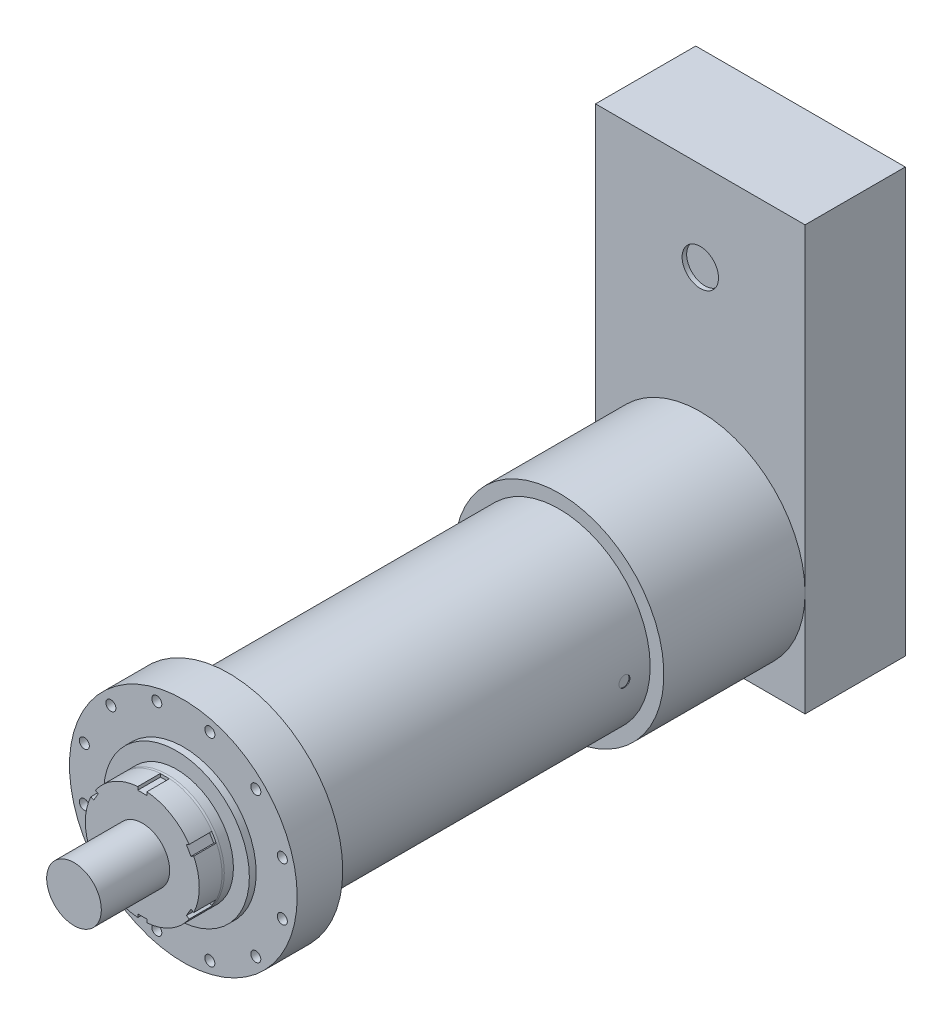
ISO-10303-21;
HEADER;
FILE_DESCRIPTION(('STEP AP214'),'2;1');
FILE_NAME('part.step','',(''),(''),'','','');
FILE_SCHEMA(('AUTOMOTIVE_DESIGN { 1 0 10303 214 1 1 1 1 }'));
ENDSEC;
DATA;
#1=APPLICATION_CONTEXT('core data for automotive mechanical design processes');
#2=APPLICATION_PROTOCOL_DEFINITION('international standard','automotive_design',2000,#1);
#3=PRODUCT_CONTEXT('',#1,'mechanical');
#4=PRODUCT('Part','Part','',(#3));
#5=PRODUCT_RELATED_PRODUCT_CATEGORY('part','',(#4));
#6=PRODUCT_DEFINITION_FORMATION('','',#4);
#7=PRODUCT_DEFINITION_CONTEXT('part definition',#1,'design');
#8=PRODUCT_DEFINITION('design','',#6,#7);
#9=PRODUCT_DEFINITION_SHAPE('','',#8);
#10=(LENGTH_UNIT() NAMED_UNIT(*) SI_UNIT(.MILLI.,.METRE.));
#11=(NAMED_UNIT(*) PLANE_ANGLE_UNIT() SI_UNIT($,.RADIAN.));
#12=(NAMED_UNIT(*) SI_UNIT($,.STERADIAN.) SOLID_ANGLE_UNIT());
#13=UNCERTAINTY_MEASURE_WITH_UNIT(LENGTH_MEASURE(1.E-05),#10,'distance_accuracy_value','');
#14=(GEOMETRIC_REPRESENTATION_CONTEXT(3) GLOBAL_UNCERTAINTY_ASSIGNED_CONTEXT((#13)) GLOBAL_UNIT_ASSIGNED_CONTEXT((#10,
#11,#12)) REPRESENTATION_CONTEXT('',''));
#15=CARTESIAN_POINT('',(0.,0.,0.));
#16=DIRECTION('',(0.,0.,1.));
#17=DIRECTION('',(1.,0.,0.));
#18=AXIS2_PLACEMENT_3D('',#15,#16,#17);
#19=CARTESIAN_POINT('',(0.,0.,865.));
#20=DIRECTION('',(0.,0.,1.));
#21=DIRECTION('',(1.,0.,0.));
#22=AXIS2_PLACEMENT_3D('',#19,#20,#21);
#23=PLANE('',#22);
#24=DIRECTION('',(0.866025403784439,-0.5,0.));
#25=VECTOR('',#24,1.);
#26=CARTESIAN_POINT('',(112.906209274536,-53.6394249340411,865.));
#27=LINE('',#26,#25);
#28=CARTESIAN_POINT('',(106.757984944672,-50.0897459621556,865.));
#29=VERTEX_POINT('',#28);
#30=CARTESIAN_POINT('',(112.140218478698,-53.1971799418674,865.));
#31=VERTEX_POINT('',#30);
#32=EDGE_CURVE('E319',#29,#31,#27,.T.);
#33=ORIENTED_EDGE('',*,*,#32,.F.);
#34=DIRECTION('',(0.5,0.866025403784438,0.));
#35=VECTOR('',#34,1.);
#36=CARTESIAN_POINT('',(106.757984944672,-50.0897459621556,865.));
#37=LINE('',#36,#35);
#38=CARTESIAN_POINT('',(96.7579849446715,-67.4102540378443,865.));
#39=VERTEX_POINT('',#38);
#40=EDGE_CURVE('E481',#39,#29,#37,.T.);
#41=ORIENTED_EDGE('',*,*,#40,.F.);
#42=DIRECTION('',(-0.866025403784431,0.500000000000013,0.));
#43=VECTOR('',#42,1.);
#44=CARTESIAN_POINT('',(96.7579849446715,-67.4102540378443,865.));
#45=LINE('',#44,#43);
#46=CARTESIAN_POINT('',(102.140218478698,-70.5176880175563,865.));
#47=VERTEX_POINT('',#46);
#48=EDGE_CURVE('E53',#47,#39,#45,.T.);
#49=ORIENTED_EDGE('',*,*,#48,.F.);
#50=CARTESIAN_POINT('',(0.,0.,865.));
#51=DIRECTION('',(0.,0.,1.));
#52=DIRECTION('',(1.,0.,0.));
#53=AXIS2_PLACEMENT_3D('',#50,#51,#52);
#54=CIRCLE('',#53,124.118365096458);
#55=EDGE_CURVE('E856',#47,#31,#54,.T.);
#56=ORIENTED_EDGE('',*,*,#55,.T.);
#57=EDGE_LOOP('',(#33,#41,#49,#56));
#58=FACE_BOUND('',#57,.T.);
#59=ADVANCED_FACE('F39',(#58),#23,.T.);
#60=DIRECTION('',(0.,-1.,0.));
#61=VECTOR('',#60,1.);
#62=CARTESIAN_POINT('',(10.,-124.599357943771,865.));
#63=LINE('',#62,#61);
#64=CARTESIAN_POINT('',(10.,-117.5,865.));
#65=VERTEX_POINT('',#64);
#66=CARTESIAN_POINT('',(10.,-123.714867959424,865.));
#67=VERTEX_POINT('',#66);
#68=EDGE_CURVE('E470',#65,#67,#63,.T.);
#69=ORIENTED_EDGE('',*,*,#68,.F.);
#70=DIRECTION('',(1.,0.,0.));
#71=VECTOR('',#70,1.);
#72=CARTESIAN_POINT('',(10.,-117.5,865.));
#73=LINE('',#72,#71);
#74=CARTESIAN_POINT('',(-9.99999999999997,-117.5,865.));
#75=VERTEX_POINT('',#74);
#76=EDGE_CURVE('E464',#75,#65,#73,.T.);
#77=ORIENTED_EDGE('',*,*,#76,.F.);
#78=DIRECTION('',(0.,1.,0.));
#79=VECTOR('',#78,1.);
#80=CARTESIAN_POINT('',(-9.99999999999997,-117.5,865.));
#81=LINE('',#80,#79);
#82=CARTESIAN_POINT('',(-10.0000000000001,-123.714867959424,865.));
#83=VERTEX_POINT('',#82);
#84=EDGE_CURVE('E465',#83,#75,#81,.T.);
#85=ORIENTED_EDGE('',*,*,#84,.F.);
#86=EDGE_CURVE('E1668',#83,#67,#54,.T.);
#87=ORIENTED_EDGE('',*,*,#86,.T.);
#88=EDGE_LOOP('',(#69,#77,#85,#87));
#89=FACE_BOUND('',#88,.T.);
#90=ADVANCED_FACE('F846',(#89),#23,.T.);
#91=DIRECTION('',(-0.866025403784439,-0.5,0.));
#92=VECTOR('',#91,1.);
#93=CARTESIAN_POINT('',(-102.906209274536,-70.95993300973,865.));
#94=LINE('',#93,#92);
#95=CARTESIAN_POINT('',(-96.7579849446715,-67.4102540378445,865.));
#96=VERTEX_POINT('',#95);
#97=CARTESIAN_POINT('',(-102.140218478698,-70.5176880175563,865.));
#98=VERTEX_POINT('',#97);
#99=EDGE_CURVE('E453',#96,#98,#94,.T.);
#100=ORIENTED_EDGE('',*,*,#99,.F.);
#101=DIRECTION('',(0.5,-0.866025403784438,0.));
#102=VECTOR('',#101,1.);
#103=CARTESIAN_POINT('',(-96.7579849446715,-67.4102540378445,865.));
#104=LINE('',#103,#102);
#105=CARTESIAN_POINT('',(-106.757984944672,-50.0897459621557,865.));
#106=VERTEX_POINT('',#105);
#107=EDGE_CURVE('E447',#106,#96,#104,.T.);
#108=ORIENTED_EDGE('',*,*,#107,.F.);
#109=DIRECTION('',(0.866025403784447,0.499999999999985,0.));
#110=VECTOR('',#109,1.);
#111=CARTESIAN_POINT('',(-106.757984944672,-50.0897459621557,865.));
#112=LINE('',#111,#110);
#113=CARTESIAN_POINT('',(-112.140218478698,-53.1971799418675,865.));
#114=VERTEX_POINT('',#113);
#115=EDGE_CURVE('E448',#114,#106,#112,.T.);
#116=ORIENTED_EDGE('',*,*,#115,.F.);
#117=EDGE_CURVE('E1659',#114,#98,#54,.T.);
#118=ORIENTED_EDGE('',*,*,#117,.T.);
#119=EDGE_LOOP('',(#100,#108,#116,#118));
#120=FACE_BOUND('',#119,.T.);
#121=ADVANCED_FACE('F851',(#120),#23,.T.);
#122=DIRECTION('',(-0.86602540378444,0.499999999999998,0.));
#123=VECTOR('',#122,1.);
#124=CARTESIAN_POINT('',(-112.906209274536,53.6394249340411,865.));
#125=LINE('',#124,#123);
#126=CARTESIAN_POINT('',(-106.757984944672,50.0897459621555,865.));
#127=VERTEX_POINT('',#126);
#128=CARTESIAN_POINT('',(-112.140218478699,53.1971799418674,865.));
#129=VERTEX_POINT('',#128);
#130=EDGE_CURVE('E436',#127,#129,#125,.T.);
#131=ORIENTED_EDGE('',*,*,#130,.F.);
#132=DIRECTION('',(-0.500000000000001,-0.866025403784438,0.));
#133=VECTOR('',#132,1.);
#134=CARTESIAN_POINT('',(-106.757984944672,50.0897459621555,865.));
#135=LINE('',#134,#133);
#136=CARTESIAN_POINT('',(-96.7579849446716,67.4102540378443,865.));
#137=VERTEX_POINT('',#136);
#138=EDGE_CURVE('E430',#137,#127,#135,.T.);
#139=ORIENTED_EDGE('',*,*,#138,.F.);
#140=DIRECTION('',(0.866025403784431,-0.500000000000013,0.));
#141=VECTOR('',#140,1.);
#142=CARTESIAN_POINT('',(-96.7579849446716,67.4102540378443,865.));
#143=LINE('',#142,#141);
#144=CARTESIAN_POINT('',(-102.140218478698,70.5176880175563,865.));
#145=VERTEX_POINT('',#144);
#146=EDGE_CURVE('E431',#145,#137,#143,.T.);
#147=ORIENTED_EDGE('',*,*,#146,.F.);
#148=EDGE_CURVE('E1650',#145,#129,#54,.T.);
#149=ORIENTED_EDGE('',*,*,#148,.T.);
#150=EDGE_LOOP('',(#131,#139,#147,#149));
#151=FACE_BOUND('',#150,.T.);
#152=ADVANCED_FACE('F912',(#151),#23,.T.);
#153=DIRECTION('',(0.,1.,0.));
#154=VECTOR('',#153,1.);
#155=CARTESIAN_POINT('',(-10.,124.599357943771,865.));
#156=LINE('',#155,#154);
#157=CARTESIAN_POINT('',(-10.,117.5,865.));
#158=VERTEX_POINT('',#157);
#159=CARTESIAN_POINT('',(-10.,123.714867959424,865.));
#160=VERTEX_POINT('',#159);
#161=EDGE_CURVE('E419',#158,#160,#156,.T.);
#162=ORIENTED_EDGE('',*,*,#161,.F.);
#163=DIRECTION('',(-1.,0.,0.));
#164=VECTOR('',#163,1.);
#165=CARTESIAN_POINT('',(-10.,117.5,865.));
#166=LINE('',#165,#164);
#167=CARTESIAN_POINT('',(9.99999999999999,117.5,865.));
#168=VERTEX_POINT('',#167);
#169=EDGE_CURVE('E413',#168,#158,#166,.T.);
#170=ORIENTED_EDGE('',*,*,#169,.F.);
#171=DIRECTION('',(0.,-1.,0.));
#172=VECTOR('',#171,1.);
#173=CARTESIAN_POINT('',(9.99999999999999,117.5,865.));
#174=LINE('',#173,#172);
#175=CARTESIAN_POINT('',(9.99999999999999,123.714867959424,865.));
#176=VERTEX_POINT('',#175);
#177=EDGE_CURVE('E414',#176,#168,#174,.T.);
#178=ORIENTED_EDGE('',*,*,#177,.F.);
#179=EDGE_CURVE('E968',#176,#160,#54,.T.);
#180=ORIENTED_EDGE('',*,*,#179,.T.);
#181=EDGE_LOOP('',(#162,#170,#178,#180));
#182=FACE_BOUND('',#181,.T.);
#183=ADVANCED_FACE('F771',(#182),#23,.T.);
#184=CARTESIAN_POINT('',(0.,0.,725.));
#185=DIRECTION('',(0.,0.,-1.));
#186=DIRECTION('',(-1.,0.,0.));
#187=AXIS2_PLACEMENT_3D('',#184,#185,#186);
#188=CYLINDRICAL_SURFACE('',#187,200.);
#189=CARTESIAN_POINT('',(200.,0.,44.5));
#190=CARTESIAN_POINT('',(200.000000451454,-0.336818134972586,44.4999972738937));
#191=CARTESIAN_POINT('',(199.999147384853,-0.673592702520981,44.5141864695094));
#192=CARTESIAN_POINT('',(199.995759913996,-1.34485594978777,44.5708419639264));
#193=CARTESIAN_POINT('',(199.993225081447,-1.67934402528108,44.6133154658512));
#194=CARTESIAN_POINT('',(199.986541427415,-2.34388649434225,44.7263038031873));
#195=CARTESIAN_POINT('',(199.982390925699,-2.67393590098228,44.7968478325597));
#196=CARTESIAN_POINT('',(199.97259396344,-3.32690256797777,44.9654685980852));
#197=CARTESIAN_POINT('',(199.966947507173,-3.64981984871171,45.063545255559));
#198=CARTESIAN_POINT('',(199.95432206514,-4.28605714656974,45.2864689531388));
#199=CARTESIAN_POINT('',(199.947343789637,-4.59938217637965,45.411301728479));
#200=CARTESIAN_POINT('',(199.932250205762,-5.21439925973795,45.6868788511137));
#201=CARTESIAN_POINT('',(199.92413488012,-5.51609113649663,45.837623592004));
#202=CARTESIAN_POINT('',(199.906998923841,-6.10563167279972,46.1639107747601));
#203=CARTESIAN_POINT('',(199.897978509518,-6.39348361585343,46.3394472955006));
#204=CARTESIAN_POINT('',(199.879285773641,-6.95338726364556,46.7140984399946));
#205=CARTESIAN_POINT('',(199.869613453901,-7.22543901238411,46.9132129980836));
#206=CARTESIAN_POINT('',(199.84987810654,-7.75214646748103,47.3338690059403));
#207=CARTESIAN_POINT('',(199.839814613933,-8.00678041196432,47.555437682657));
#208=CARTESIAN_POINT('',(199.819593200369,-8.49648428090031,48.0192286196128));
#209=CARTESIAN_POINT('',(199.809435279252,-8.73155417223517,48.2614509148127));
#210=CARTESIAN_POINT('',(199.789312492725,-9.18047473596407,48.7648450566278));
#211=CARTESIAN_POINT('',(199.779347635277,-9.39432453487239,49.0260176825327));
#212=CARTESIAN_POINT('',(199.759894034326,-9.79927768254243,49.5654558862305));
#213=CARTESIAN_POINT('',(199.750405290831,-9.99038103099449,49.8437214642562));
#214=CARTESIAN_POINT('',(199.732166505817,-10.3486167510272,50.4155890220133));
#215=CARTESIAN_POINT('',(199.723417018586,-10.5157312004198,50.7092022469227));
#216=CARTESIAN_POINT('',(199.706913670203,-10.8246278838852,51.3094920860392));
#217=CARTESIAN_POINT('',(199.699159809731,-10.9664101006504,51.6161687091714));
#218=CARTESIAN_POINT('',(199.684868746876,-11.2236267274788,52.2404038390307));
#219=CARTESIAN_POINT('',(199.678331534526,-11.3390613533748,52.5579622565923));
#220=CARTESIAN_POINT('',(199.666660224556,-11.5427558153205,53.2017032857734));
#221=CARTESIAN_POINT('',(199.661526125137,-11.631015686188,53.5278858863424));
#222=CARTESIAN_POINT('',(199.652812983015,-11.7796353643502,54.1861499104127));
#223=CARTESIAN_POINT('',(199.649232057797,-11.8400289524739,54.5182236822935));
#224=CARTESIAN_POINT('',(199.643718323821,-11.9326397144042,55.1862908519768));
#225=CARTESIAN_POINT('',(199.641785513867,-11.9648569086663,55.5222842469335));
#226=CARTESIAN_POINT('',(199.639623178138,-12.0008826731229,56.1957928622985));
#227=CARTESIAN_POINT('',(199.639393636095,-12.0046915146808,56.5333080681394));
#228=CARTESIAN_POINT('',(199.640644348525,-11.9838738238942,57.207457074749));
#229=CARTESIAN_POINT('',(199.642124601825,-11.9592473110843,57.5440908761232));
#230=CARTESIAN_POINT('',(199.646749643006,-11.881786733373,58.2136429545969));
#231=CARTESIAN_POINT('',(199.649892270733,-11.8289892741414,58.5465654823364));
#232=CARTESIAN_POINT('',(199.657751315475,-11.6955888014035,59.2067729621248));
#233=CARTESIAN_POINT('',(199.662467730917,-11.6149858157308,59.5340579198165));
#234=CARTESIAN_POINT('',(199.673340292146,-11.4265512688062,60.1806698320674));
#235=CARTESIAN_POINT('',(199.679496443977,-11.3187195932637,60.4999967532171));
#236=CARTESIAN_POINT('',(199.693073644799,-11.0765982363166,61.1284294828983));
#237=CARTESIAN_POINT('',(199.700494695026,-10.9423085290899,61.4375352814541));
#238=CARTESIAN_POINT('',(199.716396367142,-10.6481322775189,62.0435365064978));
#239=CARTESIAN_POINT('',(199.724877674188,-10.4882291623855,62.340423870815));
#240=CARTESIAN_POINT('',(199.742655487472,-10.1440259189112,62.9196760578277));
#241=CARTESIAN_POINT('',(199.75195199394,-9.95972578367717,63.2020408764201));
#242=CARTESIAN_POINT('',(199.771096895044,-9.5680341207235,63.7502561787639));
#243=CARTESIAN_POINT('',(199.780945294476,-9.36064239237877,64.0161065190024));
#244=CARTESIAN_POINT('',(199.800915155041,-8.92423659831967,64.529413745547));
#245=CARTESIAN_POINT('',(199.811036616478,-8.69522250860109,64.7768706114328));
#246=CARTESIAN_POINT('',(199.831282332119,-8.2168118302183,65.2520193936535));
#247=CARTESIAN_POINT('',(199.841406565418,-7.96738357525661,65.4796794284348));
#248=CARTESIAN_POINT('',(199.861354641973,-7.45022594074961,65.9131810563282));
#249=CARTESIAN_POINT('',(199.871178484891,-7.18249654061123,66.1190226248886));
#250=CARTESIAN_POINT('',(199.890247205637,-6.63063236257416,66.5074255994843));
#251=CARTESIAN_POINT('',(199.899492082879,-6.34649756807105,66.6899869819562));
#252=CARTESIAN_POINT('',(199.917140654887,-5.76383629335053,67.0305297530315));
#253=CARTESIAN_POINT('',(199.92554435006,-5.46530982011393,67.1885111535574));
#254=CARTESIAN_POINT('',(199.94127250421,-4.85596814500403,67.4787734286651));
#255=CARTESIAN_POINT('',(199.94859691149,-4.54515235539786,67.6110530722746));
#256=CARTESIAN_POINT('',(199.961958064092,-3.91345386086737,67.8489554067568));
#257=CARTESIAN_POINT('',(199.967994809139,-3.5925711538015,67.9545780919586));
#258=CARTESIAN_POINT('',(199.978609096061,-2.94302558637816,68.138407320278));
#259=CARTESIAN_POINT('',(199.983186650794,-2.61436279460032,68.2166141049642));
#260=CARTESIAN_POINT('',(199.990752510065,-1.95159736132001,68.3450498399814));
#261=CARTESIAN_POINT('',(199.993740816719,-1.61749472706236,68.3952788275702));
#262=CARTESIAN_POINT('',(199.998039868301,-0.946756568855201,68.467340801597));
#263=CARTESIAN_POINT('',(199.999353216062,-0.610125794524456,68.489217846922));
#264=CARTESIAN_POINT('',(200.000273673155,0.0637847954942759,68.5045628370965));
#265=CARTESIAN_POINT('',(199.999880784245,0.40106461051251,68.4980308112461));
#266=CARTESIAN_POINT('',(199.997399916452,1.07386998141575,68.4566048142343));
#267=CARTESIAN_POINT('',(199.995311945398,1.4093955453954,68.4217109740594));
#268=CARTESIAN_POINT('',(199.98950012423,2.07630576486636,68.3238125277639));
#269=CARTESIAN_POINT('',(199.985776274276,2.4076904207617,68.2608079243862));
#270=CARTESIAN_POINT('',(199.976801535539,3.06372180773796,68.1071968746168));
#271=CARTESIAN_POINT('',(199.971551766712,3.38837329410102,68.0166106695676));
#272=CARTESIAN_POINT('',(199.959672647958,4.02888618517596,67.8084689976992));
#273=CARTESIAN_POINT('',(199.953043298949,4.34474759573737,67.6909135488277));
#274=CARTESIAN_POINT('',(199.938592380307,4.96544648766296,67.4296715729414));
#275=CARTESIAN_POINT('',(199.930770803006,5.27028389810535,67.2859848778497));
#276=CARTESIAN_POINT('',(199.914156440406,5.86677844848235,66.973503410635));
#277=CARTESIAN_POINT('',(199.905363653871,6.15843557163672,66.8047086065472));
#278=CARTESIAN_POINT('',(199.887043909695,6.72686049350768,66.4429862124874));
#279=CARTESIAN_POINT('',(199.877516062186,7.00360953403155,66.2500291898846));
#280=CARTESIAN_POINT('',(199.85800533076,7.53987480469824,65.8415150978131));
#281=CARTESIAN_POINT('',(199.84802244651,7.79939102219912,65.6259580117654));
#282=CARTESIAN_POINT('',(199.827884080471,8.29935868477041,65.1737683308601));
#283=CARTESIAN_POINT('',(199.817728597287,8.53980997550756,64.9371355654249));
#284=CARTESIAN_POINT('',(199.797532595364,8.99994549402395,64.4444693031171));
#285=CARTESIAN_POINT('',(199.787492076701,9.21962970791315,64.1884357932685));
#286=CARTESIAN_POINT('',(199.767797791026,9.63694312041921,63.6584379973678));
#287=CARTESIAN_POINT('',(199.758144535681,9.83454371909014,63.3844511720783));
#288=CARTESIAN_POINT('',(199.739512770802,10.205960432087,62.8207823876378));
#289=CARTESIAN_POINT('',(199.730534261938,10.3797765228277,62.5311004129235));
#290=CARTESIAN_POINT('',(199.713507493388,10.7023843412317,61.9380971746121));
#291=CARTESIAN_POINT('',(199.70545922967,10.8511761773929,61.6347759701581));
#292=CARTESIAN_POINT('',(199.690522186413,11.1226725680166,61.0166473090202));
#293=CARTESIAN_POINT('',(199.683633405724,11.245377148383,60.7018398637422));
#294=CARTESIAN_POINT('',(199.671215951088,11.463746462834,60.0631910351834));
#295=CARTESIAN_POINT('',(199.665686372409,11.5594291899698,59.7393558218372));
#296=CARTESIAN_POINT('',(199.656139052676,11.7231767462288,59.0847544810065));
#297=CARTESIAN_POINT('',(199.652121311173,11.7912415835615,58.7539883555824));
#298=CARTESIAN_POINT('',(199.645712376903,11.8992631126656,58.0878845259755));
#299=CARTESIAN_POINT('',(199.643321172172,11.9392200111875,57.7525468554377));
#300=CARTESIAN_POINT('',(199.640233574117,11.99073839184,57.079689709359));
#301=CARTESIAN_POINT('',(199.639537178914,12.0022999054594,56.7421702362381));
#302=CARTESIAN_POINT('',(199.639858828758,11.9969484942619,56.0678915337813));
#303=CARTESIAN_POINT('',(199.640874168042,11.9800805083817,55.731131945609));
#304=CARTESIAN_POINT('',(199.644585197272,11.9180771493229,55.0602348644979));
#305=CARTESIAN_POINT('',(199.647280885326,11.8729418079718,54.7260973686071));
#306=CARTESIAN_POINT('',(199.654275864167,11.754727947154,54.0628194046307));
#307=CARTESIAN_POINT('',(199.658575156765,11.6816493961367,53.7336789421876));
#308=CARTESIAN_POINT('',(199.668655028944,11.5080731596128,53.0827324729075));
#309=CARTESIAN_POINT('',(199.674435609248,11.4075754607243,52.7609264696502));
#310=CARTESIAN_POINT('',(199.687313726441,11.1798805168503,52.1269324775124));
#311=CARTESIAN_POINT('',(199.694411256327,11.0526834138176,51.814744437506));
#312=CARTESIAN_POINT('',(199.709721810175,10.7724967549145,51.2021943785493));
#313=CARTESIAN_POINT('',(199.71793483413,10.6195071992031,50.901832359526));
#314=CARTESIAN_POINT('',(199.735243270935,10.2888285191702,50.3150654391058));
#315=CARTESIAN_POINT('',(199.744338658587,10.1111401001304,50.028660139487));
#316=CARTESIAN_POINT('',(199.763154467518,9.73232068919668,49.4718189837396));
#317=CARTESIAN_POINT('',(199.772874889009,9.53118968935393,49.201383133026));
#318=CARTESIAN_POINT('',(199.792680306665,9.10659722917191,48.678005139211));
#319=CARTESIAN_POINT('',(199.802765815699,8.88310351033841,48.4250891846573));
#320=CARTESIAN_POINT('',(199.823002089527,8.41561396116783,47.9389745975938));
#321=CARTESIAN_POINT('',(199.833152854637,8.17161803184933,47.7057760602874));
#322=CARTESIAN_POINT('',(199.853234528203,7.66478752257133,47.2606924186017));
#323=CARTESIAN_POINT('',(199.863165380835,7.40194822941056,47.0488126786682));
#324=CARTESIAN_POINT('',(199.882523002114,6.8593497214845,46.6479393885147));
#325=CARTESIAN_POINT('',(199.891949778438,6.57959076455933,46.4589454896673));
#326=CARTESIAN_POINT('',(199.910042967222,6.00478830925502,46.1049735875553));
#327=CARTESIAN_POINT('',(199.918708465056,5.7097270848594,45.9400243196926));
#328=CARTESIAN_POINT('',(199.935020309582,5.10672265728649,45.6355873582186));
#329=CARTESIAN_POINT('',(199.942666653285,4.79877941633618,45.4960997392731));
#330=CARTESIAN_POINT('',(199.95671533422,4.17252410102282,45.243718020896));
#331=CARTESIAN_POINT('',(199.96311897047,3.85422326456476,45.1307961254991));
#332=CARTESIAN_POINT('',(199.974509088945,3.20932132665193,44.9321958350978));
#333=CARTESIAN_POINT('',(199.979495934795,2.88272237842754,44.8465104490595));
#334=CARTESIAN_POINT('',(199.989051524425,2.13414018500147,44.6835216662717));
#335=CARTESIAN_POINT('',(199.99314188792,1.71026312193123,44.6147621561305));
#336=CARTESIAN_POINT('',(199.998615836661,0.857567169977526,44.5230030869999));
#337=CARTESIAN_POINT('',(199.999999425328,0.428748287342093,44.5000034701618));
#338=CARTESIAN_POINT('',(200.,0.,44.5));
#339=B_SPLINE_CURVE_WITH_KNOTS('',3,(#189,#190,#191,#192,#193,#194,#195,#196,#197,#198,#199,
#200,#201,#202,#203,#204,#205,#206,#207,#208,#209,#210,#211,#212,#213,#214,#215,#216,#217,#218,
#219,#220,#221,#222,#223,#224,#225,#226,#227,#228,#229,#230,#231,#232,#233,#234,#235,#236,#237,
#238,#239,#240,#241,#242,#243,#244,#245,#246,#247,#248,#249,#250,#251,#252,#253,#254,#255,#256,
#257,#258,#259,#260,#261,#262,#263,#264,#265,#266,#267,#268,#269,#270,#271,#272,#273,#274,#275,
#276,#277,#278,#279,#280,#281,#282,#283,#284,#285,#286,#287,#288,#289,#290,#291,#292,#293,#294,
#295,#296,#297,#298,#299,#300,#301,#302,#303,#304,#305,#306,#307,#308,#309,#310,#311,#312,#313,
#314,#315,#316,#317,#318,#319,#320,#321,#322,#323,#324,#325,#326,#327,#328,#329,#330,#331,#332,
#333,#334,#335,#336,#337,#338),.UNSPECIFIED.,.T.,.F.,(4,2,2,2,2,2,2,2,2,2,2,2,2,2,2,2,2,2,2,2,2,
2,2,2,2,2,2,2,2,2,2,2,2,2,2,2,2,2,2,2,2,2,2,2,2,2,2,2,2,2,2,2,2,2,2,2,2,2,2,2,2,2,2,2,2,2,2,2,2,
2,2,2,2,2,4),(0.,1.01007974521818,2.02041682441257,3.03180743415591,4.04319515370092,
5.0540449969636,6.06491019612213,7.07553437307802,8.08615573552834,9.09801754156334,
10.1098810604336,11.1217862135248,12.1336913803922,13.1463486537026,14.1590066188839,
15.171656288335,16.1843046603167,17.1957222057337,18.207139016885,19.2185461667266,
20.2299526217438,21.2400480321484,22.250142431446,23.2602410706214,24.2703406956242,
25.2810964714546,26.2918525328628,27.3026173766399,28.3133833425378,29.3257480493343,
30.3381138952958,31.350480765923,32.3628471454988,33.3752619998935,34.3876770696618,
35.4000832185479,36.4124880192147,37.4233176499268,38.4341462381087,39.444970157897,
40.4557939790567,41.4658777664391,42.4759608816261,43.4860504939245,44.4961413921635,
45.5074749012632,46.5188091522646,47.5301515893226,48.5414947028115,49.5541327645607,
50.566771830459,51.5794065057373,52.5920401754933,53.6039979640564,54.6159554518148,
55.6279054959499,56.6398544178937,57.650205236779,58.6605549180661,59.6709057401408,
60.6812570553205,61.6916029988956,62.7019489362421,63.7122660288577,64.7225834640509,
65.7343799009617,66.7461812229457,67.75823651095,68.7702763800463,69.7835159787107,
70.7967585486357,71.8089361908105,72.8208538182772,74.1066233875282,75.3923913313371),.UNSPECIFIED.);
#340=CARTESIAN_POINT('',(200.,0.,44.5));
#341=VERTEX_POINT('',#340);
#342=EDGE_CURVE('E43',#341,#341,#339,.T.);
#343=ORIENTED_EDGE('',*,*,#342,.T.);
#344=EDGE_LOOP('',(#343));
#345=FACE_BOUND('',#344,.T.);
#346=CARTESIAN_POINT('',(0.,0.,725.));
#347=DIRECTION('',(0.,0.,1.));
#348=DIRECTION('',(1.,0.,0.));
#349=AXIS2_PLACEMENT_3D('',#346,#347,#348);
#350=CIRCLE('',#349,200.);
#351=CARTESIAN_POINT('',(200.,0.,725.));
#352=VERTEX_POINT('',#351);
#353=EDGE_CURVE('E609',#352,#352,#350,.T.);
#354=ORIENTED_EDGE('',*,*,#353,.F.);
#355=EDGE_LOOP('',(#354));
#356=FACE_BOUND('',#355,.T.);
#357=CARTESIAN_POINT('',(0.,0.,0.));
#358=DIRECTION('',(0.,0.,1.));
#359=DIRECTION('',(1.,0.,0.));
#360=AXIS2_PLACEMENT_3D('',#357,#358,#359);
#361=CIRCLE('',#360,200.);
#362=CARTESIAN_POINT('',(200.,0.,0.));
#363=VERTEX_POINT('',#362);
#364=EDGE_CURVE('E600',#363,#363,#361,.T.);
#365=ORIENTED_EDGE('',*,*,#364,.T.);
#366=EDGE_LOOP('',(#365));
#367=FACE_BOUND('',#366,.T.);
#368=CARTESIAN_POINT('',(-200.,0.,682.5));
#369=CARTESIAN_POINT('',(-200.000000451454,0.336818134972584,682.500002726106));
#370=CARTESIAN_POINT('',(-199.999147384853,0.673592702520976,682.485813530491));
#371=CARTESIAN_POINT('',(-199.995759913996,1.34485594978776,682.429158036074));
#372=CARTESIAN_POINT('',(-199.993225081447,1.67934402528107,682.386684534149));
#373=CARTESIAN_POINT('',(-199.986541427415,2.34388649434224,682.273696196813));
#374=CARTESIAN_POINT('',(-199.982390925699,2.67393590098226,682.20315216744));
#375=CARTESIAN_POINT('',(-199.97259396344,3.32690256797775,682.034531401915));
#376=CARTESIAN_POINT('',(-199.966947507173,3.64981984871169,681.936454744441));
#377=CARTESIAN_POINT('',(-199.95432206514,4.28605714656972,681.713531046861));
#378=CARTESIAN_POINT('',(-199.947343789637,4.59938217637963,681.588698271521));
#379=CARTESIAN_POINT('',(-199.932250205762,5.21439925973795,681.313121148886));
#380=CARTESIAN_POINT('',(-199.92413488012,5.51609113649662,681.162376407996));
#381=CARTESIAN_POINT('',(-199.906998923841,6.10563167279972,680.83608922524));
#382=CARTESIAN_POINT('',(-199.897978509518,6.39348361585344,680.660552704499));
#383=CARTESIAN_POINT('',(-199.879285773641,6.95338726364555,680.285901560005));
#384=CARTESIAN_POINT('',(-199.869613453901,7.22543901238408,680.086787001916));
#385=CARTESIAN_POINT('',(-199.84987810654,7.752146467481,679.66613099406));
#386=CARTESIAN_POINT('',(-199.839814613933,8.00678041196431,679.444562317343));
#387=CARTESIAN_POINT('',(-199.819593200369,8.49648428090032,678.980771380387));
#388=CARTESIAN_POINT('',(-199.809435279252,8.73155417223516,678.738549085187));
#389=CARTESIAN_POINT('',(-199.789312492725,9.18047473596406,678.235154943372));
#390=CARTESIAN_POINT('',(-199.779347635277,9.39432453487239,677.973982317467));
#391=CARTESIAN_POINT('',(-199.759894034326,9.79927768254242,677.434544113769));
#392=CARTESIAN_POINT('',(-199.750405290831,9.99038103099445,677.156278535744));
#393=CARTESIAN_POINT('',(-199.732166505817,10.3486167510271,676.584410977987));
#394=CARTESIAN_POINT('',(-199.723417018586,10.5157312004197,676.290797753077));
#395=CARTESIAN_POINT('',(-199.706913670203,10.8246278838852,675.690507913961));
#396=CARTESIAN_POINT('',(-199.699159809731,10.9664101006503,675.383831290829));
#397=CARTESIAN_POINT('',(-199.684868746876,11.2236267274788,674.759596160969));
#398=CARTESIAN_POINT('',(-199.678331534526,11.3390613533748,674.442037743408));
#399=CARTESIAN_POINT('',(-199.666660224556,11.5427558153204,673.798296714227));
#400=CARTESIAN_POINT('',(-199.661526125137,11.631015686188,673.472114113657));
#401=CARTESIAN_POINT('',(-199.652812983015,11.7796353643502,672.813850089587));
#402=CARTESIAN_POINT('',(-199.649232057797,11.8400289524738,672.481776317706));
#403=CARTESIAN_POINT('',(-199.643718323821,11.9326397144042,671.813709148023));
#404=CARTESIAN_POINT('',(-199.641785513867,11.9648569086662,671.477715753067));
#405=CARTESIAN_POINT('',(-199.639623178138,12.0008826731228,670.804207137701));
#406=CARTESIAN_POINT('',(-199.639393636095,12.0046915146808,670.466691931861));
#407=CARTESIAN_POINT('',(-199.640644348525,11.9838738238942,669.792542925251));
#408=CARTESIAN_POINT('',(-199.642124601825,11.9592473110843,669.455909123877));
#409=CARTESIAN_POINT('',(-199.646749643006,11.881786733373,668.786357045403));
#410=CARTESIAN_POINT('',(-199.649892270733,11.8289892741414,668.453434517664));
#411=CARTESIAN_POINT('',(-199.657751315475,11.6955888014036,667.793227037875));
#412=CARTESIAN_POINT('',(-199.662467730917,11.6149858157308,667.465942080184));
#413=CARTESIAN_POINT('',(-199.673340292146,11.4265512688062,666.819330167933));
#414=CARTESIAN_POINT('',(-199.679496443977,11.3187195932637,666.500003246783));
#415=CARTESIAN_POINT('',(-199.693073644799,11.0765982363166,665.871570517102));
#416=CARTESIAN_POINT('',(-199.700494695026,10.9423085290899,665.562464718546));
#417=CARTESIAN_POINT('',(-199.716396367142,10.6481322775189,664.956463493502));
#418=CARTESIAN_POINT('',(-199.724877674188,10.4882291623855,664.659576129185));
#419=CARTESIAN_POINT('',(-199.742655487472,10.1440259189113,664.080323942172));
#420=CARTESIAN_POINT('',(-199.75195199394,9.95972578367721,663.79795912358));
#421=CARTESIAN_POINT('',(-199.771096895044,9.56803412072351,663.249743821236));
#422=CARTESIAN_POINT('',(-199.780945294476,9.36064239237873,662.983893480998));
#423=CARTESIAN_POINT('',(-199.800915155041,8.9242365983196,662.470586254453));
#424=CARTESIAN_POINT('',(-199.811036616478,8.69522250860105,662.223129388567));
#425=CARTESIAN_POINT('',(-199.831282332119,8.21681183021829,661.747980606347));
#426=CARTESIAN_POINT('',(-199.841406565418,7.96738357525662,661.520320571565));
#427=CARTESIAN_POINT('',(-199.861354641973,7.45022594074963,661.086818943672));
#428=CARTESIAN_POINT('',(-199.871178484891,7.18249654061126,660.880977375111));
#429=CARTESIAN_POINT('',(-199.890247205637,6.6306323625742,660.492574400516));
#430=CARTESIAN_POINT('',(-199.899492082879,6.34649756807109,660.310013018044));
#431=CARTESIAN_POINT('',(-199.917140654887,5.76383629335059,659.969470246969));
#432=CARTESIAN_POINT('',(-199.92554435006,5.46530982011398,659.811488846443));
#433=CARTESIAN_POINT('',(-199.94127250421,4.85596814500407,659.521226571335));
#434=CARTESIAN_POINT('',(-199.94859691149,4.54515235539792,659.388946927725));
#435=CARTESIAN_POINT('',(-199.961958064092,3.91345386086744,659.151044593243));
#436=CARTESIAN_POINT('',(-199.967994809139,3.59257115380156,659.045421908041));
#437=CARTESIAN_POINT('',(-199.978609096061,2.9430255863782,658.861592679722));
#438=CARTESIAN_POINT('',(-199.983186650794,2.61436279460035,658.783385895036));
#439=CARTESIAN_POINT('',(-199.990752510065,1.95159736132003,658.654950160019));
#440=CARTESIAN_POINT('',(-199.993740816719,1.61749472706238,658.60472117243));
#441=CARTESIAN_POINT('',(-199.998039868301,0.946756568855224,658.532659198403));
#442=CARTESIAN_POINT('',(-199.999353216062,0.610125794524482,658.510782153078));
#443=CARTESIAN_POINT('',(-200.000273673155,-0.0637847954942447,658.495437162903));
#444=CARTESIAN_POINT('',(-199.999880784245,-0.401064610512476,658.501969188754));
#445=CARTESIAN_POINT('',(-199.997399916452,-1.07386998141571,658.543395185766));
#446=CARTESIAN_POINT('',(-199.995311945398,-1.40939554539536,658.578289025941));
#447=CARTESIAN_POINT('',(-199.98950012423,-2.07630576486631,658.676187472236));
#448=CARTESIAN_POINT('',(-199.985776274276,-2.40769042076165,658.739192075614));
#449=CARTESIAN_POINT('',(-199.976801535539,-3.06372180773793,658.892803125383));
#450=CARTESIAN_POINT('',(-199.971551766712,-3.38837329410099,658.983389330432));
#451=CARTESIAN_POINT('',(-199.959672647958,-4.02888618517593,659.191531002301));
#452=CARTESIAN_POINT('',(-199.953043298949,-4.34474759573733,659.309086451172));
#453=CARTESIAN_POINT('',(-199.938592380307,-4.96544648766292,659.570328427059));
#454=CARTESIAN_POINT('',(-199.930770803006,-5.27028389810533,659.71401512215));
#455=CARTESIAN_POINT('',(-199.914156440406,-5.86677844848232,660.026496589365));
#456=CARTESIAN_POINT('',(-199.905363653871,-6.15843557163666,660.195291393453));
#457=CARTESIAN_POINT('',(-199.887043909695,-6.7268604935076,660.557013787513));
#458=CARTESIAN_POINT('',(-199.877516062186,-7.00360953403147,660.749970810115));
#459=CARTESIAN_POINT('',(-199.85800533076,-7.53987480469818,661.158484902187));
#460=CARTESIAN_POINT('',(-199.84802244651,-7.79939102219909,661.374041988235));
#461=CARTESIAN_POINT('',(-199.827884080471,-8.29935868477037,661.82623166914));
#462=CARTESIAN_POINT('',(-199.817728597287,-8.53980997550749,662.062864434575));
#463=CARTESIAN_POINT('',(-199.797532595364,-8.9999454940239,662.555530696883));
#464=CARTESIAN_POINT('',(-199.787492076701,-9.21962970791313,662.811564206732));
#465=CARTESIAN_POINT('',(-199.767797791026,-9.63694312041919,663.341562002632));
#466=CARTESIAN_POINT('',(-199.758144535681,-9.8345437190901,663.615548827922));
#467=CARTESIAN_POINT('',(-199.739512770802,-10.205960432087,664.179217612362));
#468=CARTESIAN_POINT('',(-199.730534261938,-10.3797765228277,664.468899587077));
#469=CARTESIAN_POINT('',(-199.713507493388,-10.7023843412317,665.061902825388));
#470=CARTESIAN_POINT('',(-199.70545922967,-10.8511761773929,665.365224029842));
#471=CARTESIAN_POINT('',(-199.690522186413,-11.1226725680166,665.98335269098));
#472=CARTESIAN_POINT('',(-199.683633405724,-11.245377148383,666.298160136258));
#473=CARTESIAN_POINT('',(-199.671215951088,-11.4637464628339,666.936808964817));
#474=CARTESIAN_POINT('',(-199.665686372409,-11.5594291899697,667.260644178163));
#475=CARTESIAN_POINT('',(-199.656139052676,-11.7231767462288,667.915245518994));
#476=CARTESIAN_POINT('',(-199.652121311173,-11.7912415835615,668.246011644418));
#477=CARTESIAN_POINT('',(-199.645712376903,-11.8992631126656,668.912115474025));
#478=CARTESIAN_POINT('',(-199.643321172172,-11.9392200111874,669.247453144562));
#479=CARTESIAN_POINT('',(-199.640233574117,-11.99073839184,669.920310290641));
#480=CARTESIAN_POINT('',(-199.639537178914,-12.0022999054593,670.257829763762));
#481=CARTESIAN_POINT('',(-199.639858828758,-11.9969484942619,670.932108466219));
#482=CARTESIAN_POINT('',(-199.640874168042,-11.9800805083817,671.268868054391));
#483=CARTESIAN_POINT('',(-199.644585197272,-11.9180771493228,671.939765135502));
#484=CARTESIAN_POINT('',(-199.647280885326,-11.8729418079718,672.273902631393));
#485=CARTESIAN_POINT('',(-199.654275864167,-11.754727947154,672.937180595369));
#486=CARTESIAN_POINT('',(-199.658575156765,-11.6816493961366,673.266321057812));
#487=CARTESIAN_POINT('',(-199.668655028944,-11.5080731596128,673.917267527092));
#488=CARTESIAN_POINT('',(-199.674435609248,-11.4075754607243,674.23907353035));
#489=CARTESIAN_POINT('',(-199.687313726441,-11.1798805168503,674.873067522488));
#490=CARTESIAN_POINT('',(-199.694411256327,-11.0526834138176,675.185255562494));
#491=CARTESIAN_POINT('',(-199.709721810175,-10.7724967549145,675.797805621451));
#492=CARTESIAN_POINT('',(-199.71793483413,-10.6195071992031,676.098167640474));
#493=CARTESIAN_POINT('',(-199.735243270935,-10.2888285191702,676.684934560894));
#494=CARTESIAN_POINT('',(-199.744338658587,-10.1111401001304,676.971339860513));
#495=CARTESIAN_POINT('',(-199.763154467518,-9.73232068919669,677.52818101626));
#496=CARTESIAN_POINT('',(-199.772874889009,-9.53118968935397,677.798616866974));
#497=CARTESIAN_POINT('',(-199.792680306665,-9.10659722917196,678.321994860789));
#498=CARTESIAN_POINT('',(-199.802765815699,-8.88310351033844,678.574910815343));
#499=CARTESIAN_POINT('',(-199.823002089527,-8.41561396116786,679.061025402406));
#500=CARTESIAN_POINT('',(-199.833152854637,-8.17161803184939,679.294223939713));
#501=CARTESIAN_POINT('',(-199.853234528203,-7.66478752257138,679.739307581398));
#502=CARTESIAN_POINT('',(-199.863165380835,-7.40194822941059,679.951187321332));
#503=CARTESIAN_POINT('',(-199.882523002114,-6.8593497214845,680.352060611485));
#504=CARTESIAN_POINT('',(-199.891949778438,-6.57959076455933,680.541054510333));
#505=CARTESIAN_POINT('',(-199.910042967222,-6.00478830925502,680.895026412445));
#506=CARTESIAN_POINT('',(-199.918708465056,-5.7097270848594,681.059975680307));
#507=CARTESIAN_POINT('',(-199.935020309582,-5.10672265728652,681.364412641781));
#508=CARTESIAN_POINT('',(-199.942666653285,-4.79877941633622,681.503900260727));
#509=CARTESIAN_POINT('',(-199.95671533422,-4.17252410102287,681.756281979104));
#510=CARTESIAN_POINT('',(-199.96311897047,-3.85422326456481,681.869203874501));
#511=CARTESIAN_POINT('',(-199.974509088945,-3.20932132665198,682.067804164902));
#512=CARTESIAN_POINT('',(-199.979495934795,-2.8827223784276,682.15348955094));
#513=CARTESIAN_POINT('',(-199.989051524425,-2.13414018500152,682.316478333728));
#514=CARTESIAN_POINT('',(-199.99314188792,-1.71026312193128,682.38523784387));
#515=CARTESIAN_POINT('',(-199.998615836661,-0.857567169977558,682.476996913));
#516=CARTESIAN_POINT('',(-199.999999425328,-0.428748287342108,682.499996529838));
#517=CARTESIAN_POINT('',(-200.,0.,682.5));
#518=B_SPLINE_CURVE_WITH_KNOTS('',3,(#368,#369,#370,#371,#372,#373,#374,#375,#376,#377,#378,
#379,#380,#381,#382,#383,#384,#385,#386,#387,#388,#389,#390,#391,#392,#393,#394,#395,#396,#397,
#398,#399,#400,#401,#402,#403,#404,#405,#406,#407,#408,#409,#410,#411,#412,#413,#414,#415,#416,
#417,#418,#419,#420,#421,#422,#423,#424,#425,#426,#427,#428,#429,#430,#431,#432,#433,#434,#435,
#436,#437,#438,#439,#440,#441,#442,#443,#444,#445,#446,#447,#448,#449,#450,#451,#452,#453,#454,
#455,#456,#457,#458,#459,#460,#461,#462,#463,#464,#465,#466,#467,#468,#469,#470,#471,#472,#473,
#474,#475,#476,#477,#478,#479,#480,#481,#482,#483,#484,#485,#486,#487,#488,#489,#490,#491,#492,
#493,#494,#495,#496,#497,#498,#499,#500,#501,#502,#503,#504,#505,#506,#507,#508,#509,#510,#511,
#512,#513,#514,#515,#516,#517),.UNSPECIFIED.,.T.,.F.,(4,2,2,2,2,2,2,2,2,2,2,2,2,2,2,2,2,2,2,2,2,
2,2,2,2,2,2,2,2,2,2,2,2,2,2,2,2,2,2,2,2,2,2,2,2,2,2,2,2,2,2,2,2,2,2,2,2,2,2,2,2,2,2,2,2,2,2,2,2,
2,2,2,2,2,4),(0.,1.01007974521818,2.02041682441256,3.03180743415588,4.0431951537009,
5.05404499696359,6.06491019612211,7.07553437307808,8.08615573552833,9.09801754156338,
10.1098810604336,11.1217862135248,12.1336913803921,13.1463486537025,14.1590066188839,
15.1716562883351,16.1843046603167,17.1957222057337,18.207139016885,19.2185461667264,
20.2299526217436,21.2400480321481,22.2501424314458,23.2602410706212,24.270340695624,
25.2810964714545,26.2918525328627,27.3026173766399,28.3133833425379,29.3257480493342,
30.3381138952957,31.3504807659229,32.3628471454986,33.3752619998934,34.3876770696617,
35.4000832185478,36.4124880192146,37.4233176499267,38.4341462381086,39.4449701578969,
40.4557939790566,41.465877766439,42.475960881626,43.4860504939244,44.4961413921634,
45.507474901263,46.5188091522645,47.5301515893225,48.5414947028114,49.5541327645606,
50.5667718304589,51.5794065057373,52.5920401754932,53.6039979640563,54.6159554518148,
55.6279054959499,56.6398544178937,57.650205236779,58.660554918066,59.6709057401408,
60.6812570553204,61.6916029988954,62.701948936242,63.7122660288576,64.7225834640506,
65.7343799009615,66.7461812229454,67.7582365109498,68.7702763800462,69.7835159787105,
70.7967585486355,71.8089361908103,72.8208538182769,74.106623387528,75.392391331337),.UNSPECIFIED.);
#519=CARTESIAN_POINT('',(-200.,0.,682.5));
#520=VERTEX_POINT('',#519);
#521=EDGE_CURVE('E737',#520,#520,#518,.T.);
#522=ORIENTED_EDGE('',*,*,#521,.F.);
#523=EDGE_LOOP('',(#522));
#524=FACE_BOUND('',#523,.T.);
#525=CARTESIAN_POINT('',(-200.,0.,48.5));
#526=CARTESIAN_POINT('',(-200.000000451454,0.336818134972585,48.5000027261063));
#527=CARTESIAN_POINT('',(-199.999147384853,0.673592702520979,48.4858135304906));
#528=CARTESIAN_POINT('',(-199.995759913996,1.34485594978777,48.4291580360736));
#529=CARTESIAN_POINT('',(-199.993225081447,1.67934402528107,48.3866845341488));
#530=CARTESIAN_POINT('',(-199.986541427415,2.34388649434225,48.2736961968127));
#531=CARTESIAN_POINT('',(-199.982390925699,2.67393590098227,48.2031521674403));
#532=CARTESIAN_POINT('',(-199.97259396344,3.32690256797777,48.0345314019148));
#533=CARTESIAN_POINT('',(-199.966947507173,3.64981984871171,47.936454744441));
#534=CARTESIAN_POINT('',(-199.95432206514,4.28605714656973,47.7135310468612));
#535=CARTESIAN_POINT('',(-199.947343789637,4.59938217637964,47.588698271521));
#536=CARTESIAN_POINT('',(-199.932250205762,5.21439925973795,47.3131211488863));
#537=CARTESIAN_POINT('',(-199.92413488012,5.51609113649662,47.162376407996));
#538=CARTESIAN_POINT('',(-199.906998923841,6.10563167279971,46.8360892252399));
#539=CARTESIAN_POINT('',(-199.897978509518,6.39348361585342,46.6605527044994));
#540=CARTESIAN_POINT('',(-199.879285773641,6.95338726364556,46.2859015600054));
#541=CARTESIAN_POINT('',(-199.869613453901,7.22543901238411,46.0867870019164));
#542=CARTESIAN_POINT('',(-199.84987810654,7.75214646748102,45.6661309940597));
#543=CARTESIAN_POINT('',(-199.839814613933,8.00678041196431,45.4445623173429));
#544=CARTESIAN_POINT('',(-199.819593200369,8.4964842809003,44.9807713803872));
#545=CARTESIAN_POINT('',(-199.809435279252,8.73155417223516,44.7385490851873));
#546=CARTESIAN_POINT('',(-199.789312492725,9.18047473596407,44.2351549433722));
#547=CARTESIAN_POINT('',(-199.779347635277,9.39432453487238,43.9739823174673));
#548=CARTESIAN_POINT('',(-199.759894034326,9.79927768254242,43.4345441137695));
#549=CARTESIAN_POINT('',(-199.750405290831,9.99038103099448,43.1562785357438));
#550=CARTESIAN_POINT('',(-199.732166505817,10.3486167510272,42.5844109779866));
#551=CARTESIAN_POINT('',(-199.723417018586,10.5157312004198,42.2907977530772));
#552=CARTESIAN_POINT('',(-199.706913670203,10.8246278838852,41.6905079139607));
#553=CARTESIAN_POINT('',(-199.699159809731,10.9664101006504,41.3838312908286));
#554=CARTESIAN_POINT('',(-199.684868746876,11.2236267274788,40.7595961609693));
#555=CARTESIAN_POINT('',(-199.678331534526,11.3390613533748,40.4420377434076));
#556=CARTESIAN_POINT('',(-199.666660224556,11.5427558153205,39.7982967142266));
#557=CARTESIAN_POINT('',(-199.661526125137,11.631015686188,39.4721141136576));
#558=CARTESIAN_POINT('',(-199.652812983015,11.7796353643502,38.8138500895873));
#559=CARTESIAN_POINT('',(-199.649232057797,11.8400289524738,38.4817763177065));
#560=CARTESIAN_POINT('',(-199.643718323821,11.9326397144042,37.8137091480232));
#561=CARTESIAN_POINT('',(-199.641785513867,11.9648569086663,37.4777157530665));
#562=CARTESIAN_POINT('',(-199.639623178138,12.0008826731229,36.8042071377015));
#563=CARTESIAN_POINT('',(-199.639393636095,12.0046915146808,36.4666919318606));
#564=CARTESIAN_POINT('',(-199.640644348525,11.9838738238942,35.792542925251));
#565=CARTESIAN_POINT('',(-199.642124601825,11.9592473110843,35.4559091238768));
#566=CARTESIAN_POINT('',(-199.646749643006,11.881786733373,34.7863570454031));
#567=CARTESIAN_POINT('',(-199.649892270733,11.8289892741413,34.4534345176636));
#568=CARTESIAN_POINT('',(-199.657751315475,11.6955888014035,33.7932270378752));
#569=CARTESIAN_POINT('',(-199.662467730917,11.6149858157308,33.4659420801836));
#570=CARTESIAN_POINT('',(-199.673340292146,11.4265512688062,32.8193301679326));
#571=CARTESIAN_POINT('',(-199.679496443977,11.3187195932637,32.5000032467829));
#572=CARTESIAN_POINT('',(-199.693073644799,11.0765982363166,31.8715705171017));
#573=CARTESIAN_POINT('',(-199.700494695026,10.9423085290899,31.5624647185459));
#574=CARTESIAN_POINT('',(-199.716396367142,10.6481322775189,30.9564634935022));
#575=CARTESIAN_POINT('',(-199.724877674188,10.4882291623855,30.659576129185));
#576=CARTESIAN_POINT('',(-199.742655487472,10.1440259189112,30.0803239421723));
#577=CARTESIAN_POINT('',(-199.75195199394,9.95972578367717,29.7979591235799));
#578=CARTESIAN_POINT('',(-199.771096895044,9.5680341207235,29.2497438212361));
#579=CARTESIAN_POINT('',(-199.780945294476,9.36064239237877,28.9838934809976));
#580=CARTESIAN_POINT('',(-199.800915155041,8.92423659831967,28.470586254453));
#581=CARTESIAN_POINT('',(-199.811036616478,8.69522250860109,28.2231293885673));
#582=CARTESIAN_POINT('',(-199.831282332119,8.21681183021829,27.7479806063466));
#583=CARTESIAN_POINT('',(-199.841406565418,7.96738357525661,27.5203205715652));
#584=CARTESIAN_POINT('',(-199.861354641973,7.45022594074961,27.0868189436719));
#585=CARTESIAN_POINT('',(-199.871178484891,7.18249654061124,26.8809773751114));
#586=CARTESIAN_POINT('',(-199.890247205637,6.63063236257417,26.4925744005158));
#587=CARTESIAN_POINT('',(-199.899492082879,6.34649756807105,26.3100130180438));
#588=CARTESIAN_POINT('',(-199.917140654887,5.76383629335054,25.9694702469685));
#589=CARTESIAN_POINT('',(-199.92554435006,5.46530982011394,25.8114888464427));
#590=CARTESIAN_POINT('',(-199.94127250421,4.85596814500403,25.5212265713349));
#591=CARTESIAN_POINT('',(-199.94859691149,4.54515235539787,25.3889469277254));
#592=CARTESIAN_POINT('',(-199.961958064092,3.91345386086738,25.1510445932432));
#593=CARTESIAN_POINT('',(-199.967994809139,3.59257115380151,25.0454219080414));
#594=CARTESIAN_POINT('',(-199.978609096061,2.94302558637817,24.861592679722));
#595=CARTESIAN_POINT('',(-199.983186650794,2.61436279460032,24.7833858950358));
#596=CARTESIAN_POINT('',(-199.990752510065,1.95159736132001,24.6549501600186));
#597=CARTESIAN_POINT('',(-199.993740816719,1.61749472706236,24.6047211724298));
#598=CARTESIAN_POINT('',(-199.998039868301,0.946756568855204,24.532659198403));
#599=CARTESIAN_POINT('',(-199.999353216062,0.610125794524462,24.510782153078));
#600=CARTESIAN_POINT('',(-200.000273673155,-0.0637847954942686,24.4954371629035));
#601=CARTESIAN_POINT('',(-199.999880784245,-0.401064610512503,24.5019691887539));
#602=CARTESIAN_POINT('',(-199.997399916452,-1.07386998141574,24.5433951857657));
#603=CARTESIAN_POINT('',(-199.995311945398,-1.4093955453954,24.5782890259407));
#604=CARTESIAN_POINT('',(-199.98950012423,-2.07630576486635,24.6761874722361));
#605=CARTESIAN_POINT('',(-199.985776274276,-2.40769042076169,24.7391920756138));
#606=CARTESIAN_POINT('',(-199.976801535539,-3.06372180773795,24.8928031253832));
#607=CARTESIAN_POINT('',(-199.971551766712,-3.388373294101,24.9833893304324));
#608=CARTESIAN_POINT('',(-199.959672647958,-4.02888618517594,25.1915310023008));
#609=CARTESIAN_POINT('',(-199.953043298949,-4.34474759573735,25.3090864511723));
#610=CARTESIAN_POINT('',(-199.938592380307,-4.96544648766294,25.5703284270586));
#611=CARTESIAN_POINT('',(-199.930770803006,-5.27028389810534,25.7140151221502));
#612=CARTESIAN_POINT('',(-199.914156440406,-5.86677844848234,26.026496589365));
#613=CARTESIAN_POINT('',(-199.905363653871,-6.1584355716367,26.1952913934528));
#614=CARTESIAN_POINT('',(-199.887043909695,-6.72686049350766,26.5570137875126));
#615=CARTESIAN_POINT('',(-199.877516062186,-7.00360953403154,26.7499708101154));
#616=CARTESIAN_POINT('',(-199.85800533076,-7.53987480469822,27.1584849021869));
#617=CARTESIAN_POINT('',(-199.84802244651,-7.79939102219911,27.3740419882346));
#618=CARTESIAN_POINT('',(-199.827884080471,-8.29935868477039,27.8262316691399));
#619=CARTESIAN_POINT('',(-199.817728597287,-8.53980997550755,28.0628644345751));
#620=CARTESIAN_POINT('',(-199.797532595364,-8.99994549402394,28.5555306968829));
#621=CARTESIAN_POINT('',(-199.787492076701,-9.21962970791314,28.8115642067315));
#622=CARTESIAN_POINT('',(-199.767797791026,-9.63694312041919,29.3415620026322));
#623=CARTESIAN_POINT('',(-199.758144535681,-9.83454371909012,29.6155488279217));
#624=CARTESIAN_POINT('',(-199.739512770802,-10.205960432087,30.1792176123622));
#625=CARTESIAN_POINT('',(-199.730534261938,-10.3797765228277,30.4688995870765));
#626=CARTESIAN_POINT('',(-199.713507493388,-10.7023843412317,31.0619028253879));
#627=CARTESIAN_POINT('',(-199.70545922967,-10.8511761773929,31.3652240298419));
#628=CARTESIAN_POINT('',(-199.690522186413,-11.1226725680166,31.9833526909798));
#629=CARTESIAN_POINT('',(-199.683633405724,-11.245377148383,32.2981601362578));
#630=CARTESIAN_POINT('',(-199.671215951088,-11.463746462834,32.9368089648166));
#631=CARTESIAN_POINT('',(-199.665686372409,-11.5594291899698,33.2606441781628));
#632=CARTESIAN_POINT('',(-199.656139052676,-11.7231767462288,33.9152455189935));
#633=CARTESIAN_POINT('',(-199.652121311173,-11.7912415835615,34.2460116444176));
#634=CARTESIAN_POINT('',(-199.645712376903,-11.8992631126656,34.9121154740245));
#635=CARTESIAN_POINT('',(-199.643321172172,-11.9392200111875,35.2474531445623));
#636=CARTESIAN_POINT('',(-199.640233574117,-11.99073839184,35.920310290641));
#637=CARTESIAN_POINT('',(-199.639537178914,-12.0022999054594,36.2578297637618));
#638=CARTESIAN_POINT('',(-199.639858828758,-11.9969484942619,36.9321084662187));
#639=CARTESIAN_POINT('',(-199.640874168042,-11.9800805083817,37.268868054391));
#640=CARTESIAN_POINT('',(-199.644585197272,-11.9180771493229,37.9397651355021));
#641=CARTESIAN_POINT('',(-199.647280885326,-11.8729418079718,38.2739026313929));
#642=CARTESIAN_POINT('',(-199.654275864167,-11.754727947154,38.9371805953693));
#643=CARTESIAN_POINT('',(-199.658575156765,-11.6816493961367,39.2663210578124));
#644=CARTESIAN_POINT('',(-199.668655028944,-11.5080731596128,39.9172675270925));
#645=CARTESIAN_POINT('',(-199.674435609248,-11.4075754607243,40.2390735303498));
#646=CARTESIAN_POINT('',(-199.687313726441,-11.1798805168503,40.8730675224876));
#647=CARTESIAN_POINT('',(-199.694411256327,-11.0526834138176,41.185255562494));
#648=CARTESIAN_POINT('',(-199.709721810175,-10.7724967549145,41.7978056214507));
#649=CARTESIAN_POINT('',(-199.71793483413,-10.6195071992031,42.098167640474));
#650=CARTESIAN_POINT('',(-199.735243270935,-10.2888285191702,42.6849345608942));
#651=CARTESIAN_POINT('',(-199.744338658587,-10.1111401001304,42.971339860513));
#652=CARTESIAN_POINT('',(-199.763154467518,-9.73232068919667,43.5281810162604));
#653=CARTESIAN_POINT('',(-199.772874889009,-9.53118968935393,43.798616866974));
#654=CARTESIAN_POINT('',(-199.792680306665,-9.10659722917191,44.321994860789));
#655=CARTESIAN_POINT('',(-199.802765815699,-8.8831035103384,44.5749108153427));
#656=CARTESIAN_POINT('',(-199.823002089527,-8.41561396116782,45.0610254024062));
#657=CARTESIAN_POINT('',(-199.833152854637,-8.17161803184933,45.2942239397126));
#658=CARTESIAN_POINT('',(-199.853234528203,-7.66478752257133,45.7393075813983));
#659=CARTESIAN_POINT('',(-199.863165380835,-7.40194822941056,45.9511873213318));
#660=CARTESIAN_POINT('',(-199.882523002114,-6.8593497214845,46.3520606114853));
#661=CARTESIAN_POINT('',(-199.891949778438,-6.57959076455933,46.5410545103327));
#662=CARTESIAN_POINT('',(-199.910042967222,-6.00478830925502,46.8950264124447));
#663=CARTESIAN_POINT('',(-199.918708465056,-5.70972708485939,47.0599756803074));
#664=CARTESIAN_POINT('',(-199.935020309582,-5.10672265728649,47.3644126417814));
#665=CARTESIAN_POINT('',(-199.942666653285,-4.79877941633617,47.5039002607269));
#666=CARTESIAN_POINT('',(-199.95671533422,-4.17252410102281,47.756281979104));
#667=CARTESIAN_POINT('',(-199.96311897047,-3.85422326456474,47.8692038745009));
#668=CARTESIAN_POINT('',(-199.974509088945,-3.20932132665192,48.0678041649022));
#669=CARTESIAN_POINT('',(-199.979495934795,-2.88272237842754,48.1534895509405));
#670=CARTESIAN_POINT('',(-199.989051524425,-2.13414018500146,48.3164783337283));
#671=CARTESIAN_POINT('',(-199.99314188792,-1.71026312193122,48.3852378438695));
#672=CARTESIAN_POINT('',(-199.998615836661,-0.85756716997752,48.4769969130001));
#673=CARTESIAN_POINT('',(-199.999999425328,-0.42874828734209,48.4999965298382));
#674=CARTESIAN_POINT('',(-200.,0.,48.5));
#675=B_SPLINE_CURVE_WITH_KNOTS('',3,(#525,#526,#527,#528,#529,#530,#531,#532,#533,#534,#535,
#536,#537,#538,#539,#540,#541,#542,#543,#544,#545,#546,#547,#548,#549,#550,#551,#552,#553,#554,
#555,#556,#557,#558,#559,#560,#561,#562,#563,#564,#565,#566,#567,#568,#569,#570,#571,#572,#573,
#574,#575,#576,#577,#578,#579,#580,#581,#582,#583,#584,#585,#586,#587,#588,#589,#590,#591,#592,
#593,#594,#595,#596,#597,#598,#599,#600,#601,#602,#603,#604,#605,#606,#607,#608,#609,#610,#611,
#612,#613,#614,#615,#616,#617,#618,#619,#620,#621,#622,#623,#624,#625,#626,#627,#628,#629,#630,
#631,#632,#633,#634,#635,#636,#637,#638,#639,#640,#641,#642,#643,#644,#645,#646,#647,#648,#649,
#650,#651,#652,#653,#654,#655,#656,#657,#658,#659,#660,#661,#662,#663,#664,#665,#666,#667,#668,
#669,#670,#671,#672,#673,#674),.UNSPECIFIED.,.T.,.F.,(4,2,2,2,2,2,2,2,2,2,2,2,2,2,2,2,2,2,2,2,2,
2,2,2,2,2,2,2,2,2,2,2,2,2,2,2,2,2,2,2,2,2,2,2,2,2,2,2,2,2,2,2,2,2,2,2,2,2,2,2,2,2,2,2,2,2,2,2,2,
2,2,2,2,2,4),(0.,1.01007974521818,2.02041682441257,3.03180743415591,4.04319515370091,
5.05404499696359,6.06491019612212,7.07553437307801,8.08615573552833,9.09801754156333,
10.1098810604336,11.1217862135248,12.1336913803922,13.1463486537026,14.1590066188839,
15.171656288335,16.1843046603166,17.1957222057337,18.207139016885,19.2185461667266,
20.2299526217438,21.2400480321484,22.250142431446,23.2602410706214,24.2703406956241,
25.2810964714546,26.2918525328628,27.3026173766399,28.3133833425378,29.3257480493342,
30.3381138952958,31.350480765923,32.3628471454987,33.3752619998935,34.3876770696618,
35.4000832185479,36.4124880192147,37.4233176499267,38.4341462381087,39.444970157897,
40.4557939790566,41.4658777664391,42.475960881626,43.4860504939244,44.4961413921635,
45.5074749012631,46.5188091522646,47.5301515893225,48.5414947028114,49.5541327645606,
50.5667718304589,51.5794065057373,52.5920401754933,53.6039979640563,54.6159554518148,
55.6279054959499,56.6398544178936,57.6502052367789,58.660554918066,59.6709057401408,
60.6812570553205,61.6916029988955,62.7019489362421,63.7122660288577,64.7225834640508,
65.7343799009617,66.7461812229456,67.75823651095,68.7702763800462,69.7835159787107,
70.7967585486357,71.8089361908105,72.8208538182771,74.1066233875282,75.392391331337),.UNSPECIFIED.);
#676=CARTESIAN_POINT('',(-200.,0.,48.5));
#677=VERTEX_POINT('',#676);
#678=EDGE_CURVE('E744',#677,#677,#675,.T.);
#679=ORIENTED_EDGE('',*,*,#678,.F.);
#680=EDGE_LOOP('',(#679));
#681=FACE_BOUND('',#680,.T.);
#682=ADVANCED_FACE('F749',(#345,#356,#367,#524,#681),#188,.T.);
#683=CARTESIAN_POINT('',(0.,0.,825.));
#684=DIRECTION('',(0.,0.,1.));
#685=DIRECTION('',(1.,0.,0.));
#686=AXIS2_PLACEMENT_3D('',#683,#684,#685);
#687=PLANE('',#686);
#688=CARTESIAN_POINT('',(0.,0.,825.));
#689=DIRECTION('',(0.,0.,1.));
#690=DIRECTION('',(1.,0.,0.));
#691=AXIS2_PLACEMENT_3D('',#688,#689,#690);
#692=CIRCLE('',#691,160.);
#693=CARTESIAN_POINT('',(160.,0.,825.));
#694=VERTEX_POINT('',#693);
#695=EDGE_CURVE('E615',#694,#694,#692,.T.);
#696=ORIENTED_EDGE('',*,*,#695,.F.);
#697=EDGE_LOOP('',(#696));
#698=FACE_BOUND('',#697,.T.);
#699=CARTESIAN_POINT('',(58.2342851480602,217.333310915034,825.));
#700=DIRECTION('',(0.,0.,1.));
#701=DIRECTION('',(1.,0.,0.));
#702=AXIS2_PLACEMENT_3D('',#699,#700,#701);
#703=CIRCLE('',#702,11.0000000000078);
#704=CARTESIAN_POINT('',(69.234285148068,217.333310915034,825.));
#705=VERTEX_POINT('',#704);
#706=EDGE_CURVE('E627',#705,#705,#703,.T.);
#707=ORIENTED_EDGE('',*,*,#706,.F.);
#708=EDGE_LOOP('',(#707));
#709=FACE_BOUND('',#708,.T.);
#710=CARTESIAN_POINT('',(-159.099025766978,159.099025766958,825.));
#711=DIRECTION('',(0.,0.,1.));
#712=DIRECTION('',(1.,0.,0.));
#713=AXIS2_PLACEMENT_3D('',#710,#711,#712);
#714=CIRCLE('',#713,11.0000000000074);
#715=CARTESIAN_POINT('',(-148.09902576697,159.099025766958,825.));
#716=VERTEX_POINT('',#715);
#717=EDGE_CURVE('E643',#716,#716,#714,.T.);
#718=ORIENTED_EDGE('',*,*,#717,.F.);
#719=EDGE_LOOP('',(#718));
#720=FACE_BOUND('',#719,.T.);
#721=CARTESIAN_POINT('',(-217.333310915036,-58.2342851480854,825.));
#722=DIRECTION('',(0.,0.,1.));
#723=DIRECTION('',(1.,0.,0.));
#724=AXIS2_PLACEMENT_3D('',#721,#722,#723);
#725=CIRCLE('',#724,10.9999999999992);
#726=CARTESIAN_POINT('',(-206.333310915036,-58.2342851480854,825.));
#727=VERTEX_POINT('',#726);
#728=EDGE_CURVE('E659',#727,#727,#725,.T.);
#729=ORIENTED_EDGE('',*,*,#728,.F.);
#730=EDGE_LOOP('',(#729));
#731=FACE_BOUND('',#730,.T.);
#732=CARTESIAN_POINT('',(-58.2342851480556,-217.333310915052,825.));
#733=DIRECTION('',(0.,0.,1.));
#734=DIRECTION('',(1.,0.,0.));
#735=AXIS2_PLACEMENT_3D('',#732,#733,#734);
#736=CIRCLE('',#735,10.9999999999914);
#737=CARTESIAN_POINT('',(-47.2342851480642,-217.333310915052,825.));
#738=VERTEX_POINT('',#737);
#739=EDGE_CURVE('E675',#738,#738,#736,.T.);
#740=ORIENTED_EDGE('',*,*,#739,.F.);
#741=EDGE_LOOP('',(#740));
#742=FACE_BOUND('',#741,.T.);
#743=CARTESIAN_POINT('',(159.099025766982,-159.099025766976,825.));
#744=DIRECTION('',(0.,0.,1.));
#745=DIRECTION('',(1.,0.,0.));
#746=AXIS2_PLACEMENT_3D('',#743,#744,#745);
#747=CIRCLE('',#746,10.9999999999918);
#748=CARTESIAN_POINT('',(170.099025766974,-159.099025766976,825.));
#749=VERTEX_POINT('',#748);
#750=EDGE_CURVE('E691',#749,#749,#747,.T.);
#751=ORIENTED_EDGE('',*,*,#750,.F.);
#752=EDGE_LOOP('',(#751));
#753=FACE_BOUND('',#752,.T.);
#754=CARTESIAN_POINT('',(217.33331091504,58.2342851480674,825.));
#755=DIRECTION('',(0.,0.,1.));
#756=DIRECTION('',(1.,0.,0.));
#757=AXIS2_PLACEMENT_3D('',#754,#755,#756);
#758=CIRCLE('',#757,11.);
#759=CARTESIAN_POINT('',(228.33331091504,58.2342851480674,825.));
#760=VERTEX_POINT('',#759);
#761=EDGE_CURVE('E707',#760,#760,#758,.T.);
#762=ORIENTED_EDGE('',*,*,#761,.F.);
#763=EDGE_LOOP('',(#762));
#764=FACE_BOUND('',#763,.T.);
#765=CARTESIAN_POINT('',(0.,0.,825.));
#766=DIRECTION('',(0.,0.,1.));
#767=DIRECTION('',(1.,0.,0.));
#768=AXIS2_PLACEMENT_3D('',#765,#766,#767);
#769=CIRCLE('',#768,250.);
#770=CARTESIAN_POINT('',(250.,0.,825.));
#771=VERTEX_POINT('',#770);
#772=EDGE_CURVE('E715',#771,#771,#769,.T.);
#773=ORIENTED_EDGE('',*,*,#772,.T.);
#774=EDGE_LOOP('',(#773));
#775=FACE_BOUND('',#774,.T.);
#776=CARTESIAN_POINT('',(217.33331091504,-58.2342851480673,825.));
#777=DIRECTION('',(0.,0.,1.));
#778=DIRECTION('',(1.,0.,0.));
#779=AXIS2_PLACEMENT_3D('',#776,#777,#778);
#780=CIRCLE('',#779,11.);
#781=CARTESIAN_POINT('',(228.33331091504,-58.2342851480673,825.));
#782=VERTEX_POINT('',#781);
#783=EDGE_CURVE('E699',#782,#782,#780,.T.);
#784=ORIENTED_EDGE('',*,*,#783,.F.);
#785=EDGE_LOOP('',(#784));
#786=FACE_BOUND('',#785,.T.);
#787=CARTESIAN_POINT('',(58.2342851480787,-217.333310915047,825.));
#788=DIRECTION('',(0.,0.,1.));
#789=DIRECTION('',(1.,0.,0.));
#790=AXIS2_PLACEMENT_3D('',#787,#788,#789);
#791=CIRCLE('',#790,10.9999999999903);
#792=CARTESIAN_POINT('',(69.234285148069,-217.333310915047,825.));
#793=VERTEX_POINT('',#792);
#794=EDGE_CURVE('E683',#793,#793,#791,.T.);
#795=ORIENTED_EDGE('',*,*,#794,.F.);
#796=EDGE_LOOP('',(#795));
#797=FACE_BOUND('',#796,.T.);
#798=CARTESIAN_POINT('',(-159.099025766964,-159.099025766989,825.));
#799=DIRECTION('',(0.,0.,1.));
#800=DIRECTION('',(1.,0.,0.));
#801=AXIS2_PLACEMENT_3D('',#798,#799,#800);
#802=CIRCLE('',#801,10.9999999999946);
#803=CARTESIAN_POINT('',(-148.09902576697,-159.099025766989,825.));
#804=VERTEX_POINT('',#803);
#805=EDGE_CURVE('E667',#804,#804,#802,.T.);
#806=ORIENTED_EDGE('',*,*,#805,.F.);
#807=EDGE_LOOP('',(#806));
#808=FACE_BOUND('',#807,.T.);
#809=CARTESIAN_POINT('',(-217.333310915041,58.234285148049,825.));
#810=DIRECTION('',(0.,0.,1.));
#811=DIRECTION('',(1.,0.,0.));
#812=AXIS2_PLACEMENT_3D('',#809,#810,#811);
#813=CIRCLE('',#812,11.0000000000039);
#814=CARTESIAN_POINT('',(-206.333310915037,58.234285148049,825.));
#815=VERTEX_POINT('',#814);
#816=EDGE_CURVE('E651',#815,#815,#813,.T.);
#817=ORIENTED_EDGE('',*,*,#816,.F.);
#818=EDGE_LOOP('',(#817));
#819=FACE_BOUND('',#818,.T.);
#820=CARTESIAN_POINT('',(-58.234285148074,217.333310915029,825.));
#821=DIRECTION('',(0.,0.,1.));
#822=DIRECTION('',(1.,0.,0.));
#823=AXIS2_PLACEMENT_3D('',#820,#821,#822);
#824=CIRCLE('',#823,11.0000000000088);
#825=CARTESIAN_POINT('',(-47.2342851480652,217.333310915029,825.));
#826=VERTEX_POINT('',#825);
#827=EDGE_CURVE('E635',#826,#826,#824,.T.);
#828=ORIENTED_EDGE('',*,*,#827,.F.);
#829=EDGE_LOOP('',(#828));
#830=FACE_BOUND('',#829,.T.);
#831=CARTESIAN_POINT('',(159.099025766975,159.099025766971,825.));
#832=DIRECTION('',(0.,0.,1.));
#833=DIRECTION('',(1.,0.,0.));
#834=AXIS2_PLACEMENT_3D('',#831,#832,#833);
#835=CIRCLE('',#834,11.);
#836=CARTESIAN_POINT('',(170.099025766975,159.099025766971,825.));
#837=VERTEX_POINT('',#836);
#838=EDGE_CURVE('E619',#837,#837,#835,.T.);
#839=ORIENTED_EDGE('',*,*,#838,.F.);
#840=EDGE_LOOP('',(#839));
#841=FACE_BOUND('',#840,.T.);
#842=ADVANCED_FACE('F832',(#698,#709,#720,#731,#742,#753,#764,#775,#786,#797,#808,#819,#830,
#841),#687,.T.);
#843=CARTESIAN_POINT('',(0.,0.,725.));
#844=DIRECTION('',(0.,0.,1.));
#845=DIRECTION('',(1.,0.,0.));
#846=AXIS2_PLACEMENT_3D('',#843,#844,#845);
#847=PLANE('',#846);
#848=ORIENTED_EDGE('',*,*,#353,.T.);
#849=EDGE_LOOP('',(#848));
#850=FACE_BOUND('',#849,.T.);
#851=CARTESIAN_POINT('',(0.,0.,725.));
#852=DIRECTION('',(0.,0.,1.));
#853=DIRECTION('',(1.,0.,0.));
#854=AXIS2_PLACEMENT_3D('',#851,#852,#853);
#855=CIRCLE('',#854,250.);
#856=CARTESIAN_POINT('',(250.,0.,725.));
#857=VERTEX_POINT('',#856);
#858=EDGE_CURVE('E711',#857,#857,#855,.T.);
#859=ORIENTED_EDGE('',*,*,#858,.F.);
#860=EDGE_LOOP('',(#859));
#861=FACE_BOUND('',#860,.T.);
#862=CARTESIAN_POINT('',(217.33331091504,58.2342851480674,725.));
#863=DIRECTION('',(0.,0.,1.));
#864=DIRECTION('',(1.,0.,0.));
#865=AXIS2_PLACEMENT_3D('',#862,#863,#864);
#866=CIRCLE('',#865,11.);
#867=CARTESIAN_POINT('',(228.33331091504,58.2342851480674,725.));
#868=VERTEX_POINT('',#867);
#869=EDGE_CURVE('E703',#868,#868,#866,.T.);
#870=ORIENTED_EDGE('',*,*,#869,.T.);
#871=EDGE_LOOP('',(#870));
#872=FACE_BOUND('',#871,.T.);
#873=CARTESIAN_POINT('',(217.33331091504,-58.2342851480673,725.));
#874=DIRECTION('',(0.,0.,1.));
#875=DIRECTION('',(1.,0.,0.));
#876=AXIS2_PLACEMENT_3D('',#873,#874,#875);
#877=CIRCLE('',#876,11.);
#878=CARTESIAN_POINT('',(228.33331091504,-58.2342851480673,725.));
#879=VERTEX_POINT('',#878);
#880=EDGE_CURVE('E695',#879,#879,#877,.T.);
#881=ORIENTED_EDGE('',*,*,#880,.T.);
#882=EDGE_LOOP('',(#881));
#883=FACE_BOUND('',#882,.T.);
#884=CARTESIAN_POINT('',(159.099025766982,-159.099025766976,725.));
#885=DIRECTION('',(0.,0.,1.));
#886=DIRECTION('',(1.,0.,0.));
#887=AXIS2_PLACEMENT_3D('',#884,#885,#886);
#888=CIRCLE('',#887,10.9999999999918);
#889=CARTESIAN_POINT('',(170.099025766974,-159.099025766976,725.));
#890=VERTEX_POINT('',#889);
#891=EDGE_CURVE('E687',#890,#890,#888,.T.);
#892=ORIENTED_EDGE('',*,*,#891,.T.);
#893=EDGE_LOOP('',(#892));
#894=FACE_BOUND('',#893,.T.);
#895=CARTESIAN_POINT('',(58.2342851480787,-217.333310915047,725.));
#896=DIRECTION('',(0.,0.,1.));
#897=DIRECTION('',(1.,0.,0.));
#898=AXIS2_PLACEMENT_3D('',#895,#896,#897);
#899=CIRCLE('',#898,10.9999999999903);
#900=CARTESIAN_POINT('',(69.234285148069,-217.333310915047,725.));
#901=VERTEX_POINT('',#900);
#902=EDGE_CURVE('E679',#901,#901,#899,.T.);
#903=ORIENTED_EDGE('',*,*,#902,.T.);
#904=EDGE_LOOP('',(#903));
#905=FACE_BOUND('',#904,.T.);
#906=CARTESIAN_POINT('',(-58.2342851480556,-217.333310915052,725.));
#907=DIRECTION('',(0.,0.,1.));
#908=DIRECTION('',(1.,0.,0.));
#909=AXIS2_PLACEMENT_3D('',#906,#907,#908);
#910=CIRCLE('',#909,10.9999999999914);
#911=CARTESIAN_POINT('',(-47.2342851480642,-217.333310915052,725.));
#912=VERTEX_POINT('',#911);
#913=EDGE_CURVE('E671',#912,#912,#910,.T.);
#914=ORIENTED_EDGE('',*,*,#913,.T.);
#915=EDGE_LOOP('',(#914));
#916=FACE_BOUND('',#915,.T.);
#917=CARTESIAN_POINT('',(-159.099025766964,-159.099025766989,725.));
#918=DIRECTION('',(0.,0.,1.));
#919=DIRECTION('',(1.,0.,0.));
#920=AXIS2_PLACEMENT_3D('',#917,#918,#919);
#921=CIRCLE('',#920,10.9999999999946);
#922=CARTESIAN_POINT('',(-148.09902576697,-159.099025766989,725.));
#923=VERTEX_POINT('',#922);
#924=EDGE_CURVE('E663',#923,#923,#921,.T.);
#925=ORIENTED_EDGE('',*,*,#924,.T.);
#926=EDGE_LOOP('',(#925));
#927=FACE_BOUND('',#926,.T.);
#928=CARTESIAN_POINT('',(-217.333310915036,-58.2342851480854,725.));
#929=DIRECTION('',(0.,0.,1.));
#930=DIRECTION('',(1.,0.,0.));
#931=AXIS2_PLACEMENT_3D('',#928,#929,#930);
#932=CIRCLE('',#931,10.9999999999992);
#933=CARTESIAN_POINT('',(-206.333310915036,-58.2342851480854,725.));
#934=VERTEX_POINT('',#933);
#935=EDGE_CURVE('E655',#934,#934,#932,.T.);
#936=ORIENTED_EDGE('',*,*,#935,.T.);
#937=EDGE_LOOP('',(#936));
#938=FACE_BOUND('',#937,.T.);
#939=CARTESIAN_POINT('',(-217.333310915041,58.234285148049,725.));
#940=DIRECTION('',(0.,0.,1.));
#941=DIRECTION('',(1.,0.,0.));
#942=AXIS2_PLACEMENT_3D('',#939,#940,#941);
#943=CIRCLE('',#942,11.0000000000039);
#944=CARTESIAN_POINT('',(-206.333310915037,58.234285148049,725.));
#945=VERTEX_POINT('',#944);
#946=EDGE_CURVE('E647',#945,#945,#943,.T.);
#947=ORIENTED_EDGE('',*,*,#946,.T.);
#948=EDGE_LOOP('',(#947));
#949=FACE_BOUND('',#948,.T.);
#950=CARTESIAN_POINT('',(-159.099025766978,159.099025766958,725.));
#951=DIRECTION('',(0.,0.,1.));
#952=DIRECTION('',(1.,0.,0.));
#953=AXIS2_PLACEMENT_3D('',#950,#951,#952);
#954=CIRCLE('',#953,11.0000000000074);
#955=CARTESIAN_POINT('',(-148.09902576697,159.099025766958,725.));
#956=VERTEX_POINT('',#955);
#957=EDGE_CURVE('E639',#956,#956,#954,.T.);
#958=ORIENTED_EDGE('',*,*,#957,.T.);
#959=EDGE_LOOP('',(#958));
#960=FACE_BOUND('',#959,.T.);
#961=CARTESIAN_POINT('',(-58.234285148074,217.333310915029,725.));
#962=DIRECTION('',(0.,0.,1.));
#963=DIRECTION('',(1.,0.,0.));
#964=AXIS2_PLACEMENT_3D('',#961,#962,#963);
#965=CIRCLE('',#964,11.0000000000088);
#966=CARTESIAN_POINT('',(-47.2342851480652,217.333310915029,725.));
#967=VERTEX_POINT('',#966);
#968=EDGE_CURVE('E631',#967,#967,#965,.T.);
#969=ORIENTED_EDGE('',*,*,#968,.T.);
#970=EDGE_LOOP('',(#969));
#971=FACE_BOUND('',#970,.T.);
#972=CARTESIAN_POINT('',(58.2342851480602,217.333310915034,725.));
#973=DIRECTION('',(0.,0.,1.));
#974=DIRECTION('',(1.,0.,0.));
#975=AXIS2_PLACEMENT_3D('',#972,#973,#974);
#976=CIRCLE('',#975,11.0000000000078);
#977=CARTESIAN_POINT('',(69.234285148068,217.333310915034,725.));
#978=VERTEX_POINT('',#977);
#979=EDGE_CURVE('E623',#978,#978,#976,.T.);
#980=ORIENTED_EDGE('',*,*,#979,.T.);
#981=EDGE_LOOP('',(#980));
#982=FACE_BOUND('',#981,.T.);
#983=CARTESIAN_POINT('',(159.099025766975,159.099025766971,725.));
#984=DIRECTION('',(0.,0.,1.));
#985=DIRECTION('',(1.,0.,0.));
#986=AXIS2_PLACEMENT_3D('',#983,#984,#985);
#987=CIRCLE('',#986,11.);
#988=CARTESIAN_POINT('',(170.099025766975,159.099025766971,725.));
#989=VERTEX_POINT('',#988);
#990=EDGE_CURVE('E614',#989,#989,#987,.T.);
#991=ORIENTED_EDGE('',*,*,#990,.T.);
#992=EDGE_LOOP('',(#991));
#993=FACE_BOUND('',#992,.T.);
#994=ADVANCED_FACE('F835',(#850,#861,#872,#883,#894,#905,#916,#927,#938,#949,#960,#971,#982,
#993),#847,.F.);
#995=CARTESIAN_POINT('',(0.,0.,825.));
#996=DIRECTION('',(0.,0.,-1.));
#997=DIRECTION('',(-1.,0.,0.));
#998=AXIS2_PLACEMENT_3D('',#995,#996,#997);
#999=CYLINDRICAL_SURFACE('',#998,250.);
#1000=ORIENTED_EDGE('',*,*,#772,.F.);
#1001=EDGE_LOOP('',(#1000));
#1002=FACE_BOUND('',#1001,.T.);
#1003=ORIENTED_EDGE('',*,*,#858,.T.);
#1004=EDGE_LOOP('',(#1003));
#1005=FACE_BOUND('',#1004,.T.);
#1006=ADVANCED_FACE('F830',(#1002,#1005),#999,.T.);
#1007=CARTESIAN_POINT('',(217.33331091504,58.2342851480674,825.));
#1008=DIRECTION('',(0.,0.,-1.));
#1009=DIRECTION('',(-1.,0.,0.));
#1010=AXIS2_PLACEMENT_3D('',#1007,#1008,#1009);
#1011=CYLINDRICAL_SURFACE('',#1010,11.);
#1012=ORIENTED_EDGE('',*,*,#761,.T.);
#1013=EDGE_LOOP('',(#1012));
#1014=FACE_BOUND('',#1013,.T.);
#1015=ORIENTED_EDGE('',*,*,#869,.F.);
#1016=EDGE_LOOP('',(#1015));
#1017=FACE_BOUND('',#1016,.T.);
#1018=ADVANCED_FACE('F826',(#1014,#1017),#1011,.F.);
#1019=CARTESIAN_POINT('',(217.33331091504,-58.2342851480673,825.));
#1020=DIRECTION('',(0.,0.,-1.));
#1021=DIRECTION('',(-1.,0.,0.));
#1022=AXIS2_PLACEMENT_3D('',#1019,#1020,#1021);
#1023=CYLINDRICAL_SURFACE('',#1022,11.);
#1024=ORIENTED_EDGE('',*,*,#783,.T.);
#1025=EDGE_LOOP('',(#1024));
#1026=FACE_BOUND('',#1025,.T.);
#1027=ORIENTED_EDGE('',*,*,#880,.F.);
#1028=EDGE_LOOP('',(#1027));
#1029=FACE_BOUND('',#1028,.T.);
#1030=ADVANCED_FACE('F822',(#1026,#1029),#1023,.F.);
#1031=CARTESIAN_POINT('',(159.099025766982,-159.099025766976,825.));
#1032=DIRECTION('',(0.,0.,-1.));
#1033=DIRECTION('',(-1.,0.,0.));
#1034=AXIS2_PLACEMENT_3D('',#1031,#1032,#1033);
#1035=CYLINDRICAL_SURFACE('',#1034,10.9999999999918);
#1036=ORIENTED_EDGE('',*,*,#750,.T.);
#1037=EDGE_LOOP('',(#1036));
#1038=FACE_BOUND('',#1037,.T.);
#1039=ORIENTED_EDGE('',*,*,#891,.F.);
#1040=EDGE_LOOP('',(#1039));
#1041=FACE_BOUND('',#1040,.T.);
#1042=ADVANCED_FACE('F818',(#1038,#1041),#1035,.F.);
#1043=CARTESIAN_POINT('',(58.2342851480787,-217.333310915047,825.));
#1044=DIRECTION('',(0.,0.,-1.));
#1045=DIRECTION('',(-1.,0.,0.));
#1046=AXIS2_PLACEMENT_3D('',#1043,#1044,#1045);
#1047=CYLINDRICAL_SURFACE('',#1046,10.9999999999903);
#1048=ORIENTED_EDGE('',*,*,#794,.T.);
#1049=EDGE_LOOP('',(#1048));
#1050=FACE_BOUND('',#1049,.T.);
#1051=ORIENTED_EDGE('',*,*,#902,.F.);
#1052=EDGE_LOOP('',(#1051));
#1053=FACE_BOUND('',#1052,.T.);
#1054=ADVANCED_FACE('F814',(#1050,#1053),#1047,.F.);
#1055=CARTESIAN_POINT('',(-58.2342851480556,-217.333310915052,825.));
#1056=DIRECTION('',(0.,0.,-1.));
#1057=DIRECTION('',(-1.,0.,0.));
#1058=AXIS2_PLACEMENT_3D('',#1055,#1056,#1057);
#1059=CYLINDRICAL_SURFACE('',#1058,10.9999999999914);
#1060=ORIENTED_EDGE('',*,*,#739,.T.);
#1061=EDGE_LOOP('',(#1060));
#1062=FACE_BOUND('',#1061,.T.);
#1063=ORIENTED_EDGE('',*,*,#913,.F.);
#1064=EDGE_LOOP('',(#1063));
#1065=FACE_BOUND('',#1064,.T.);
#1066=ADVANCED_FACE('F810',(#1062,#1065),#1059,.F.);
#1067=CARTESIAN_POINT('',(-159.099025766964,-159.099025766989,825.));
#1068=DIRECTION('',(0.,0.,-1.));
#1069=DIRECTION('',(-1.,0.,0.));
#1070=AXIS2_PLACEMENT_3D('',#1067,#1068,#1069);
#1071=CYLINDRICAL_SURFACE('',#1070,10.9999999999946);
#1072=ORIENTED_EDGE('',*,*,#805,.T.);
#1073=EDGE_LOOP('',(#1072));
#1074=FACE_BOUND('',#1073,.T.);
#1075=ORIENTED_EDGE('',*,*,#924,.F.);
#1076=EDGE_LOOP('',(#1075));
#1077=FACE_BOUND('',#1076,.T.);
#1078=ADVANCED_FACE('F806',(#1074,#1077),#1071,.F.);
#1079=CARTESIAN_POINT('',(-217.333310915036,-58.2342851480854,825.));
#1080=DIRECTION('',(0.,0.,-1.));
#1081=DIRECTION('',(-1.,0.,0.));
#1082=AXIS2_PLACEMENT_3D('',#1079,#1080,#1081);
#1083=CYLINDRICAL_SURFACE('',#1082,10.9999999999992);
#1084=ORIENTED_EDGE('',*,*,#728,.T.);
#1085=EDGE_LOOP('',(#1084));
#1086=FACE_BOUND('',#1085,.T.);
#1087=ORIENTED_EDGE('',*,*,#935,.F.);
#1088=EDGE_LOOP('',(#1087));
#1089=FACE_BOUND('',#1088,.T.);
#1090=ADVANCED_FACE('F802',(#1086,#1089),#1083,.F.);
#1091=CARTESIAN_POINT('',(-217.333310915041,58.234285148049,825.));
#1092=DIRECTION('',(0.,0.,-1.));
#1093=DIRECTION('',(-1.,0.,0.));
#1094=AXIS2_PLACEMENT_3D('',#1091,#1092,#1093);
#1095=CYLINDRICAL_SURFACE('',#1094,11.0000000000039);
#1096=ORIENTED_EDGE('',*,*,#816,.T.);
#1097=EDGE_LOOP('',(#1096));
#1098=FACE_BOUND('',#1097,.T.);
#1099=ORIENTED_EDGE('',*,*,#946,.F.);
#1100=EDGE_LOOP('',(#1099));
#1101=FACE_BOUND('',#1100,.T.);
#1102=ADVANCED_FACE('F798',(#1098,#1101),#1095,.F.);
#1103=CARTESIAN_POINT('',(-159.099025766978,159.099025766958,825.));
#1104=DIRECTION('',(0.,0.,-1.));
#1105=DIRECTION('',(-1.,0.,0.));
#1106=AXIS2_PLACEMENT_3D('',#1103,#1104,#1105);
#1107=CYLINDRICAL_SURFACE('',#1106,11.0000000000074);
#1108=ORIENTED_EDGE('',*,*,#717,.T.);
#1109=EDGE_LOOP('',(#1108));
#1110=FACE_BOUND('',#1109,.T.);
#1111=ORIENTED_EDGE('',*,*,#957,.F.);
#1112=EDGE_LOOP('',(#1111));
#1113=FACE_BOUND('',#1112,.T.);
#1114=ADVANCED_FACE('F794',(#1110,#1113),#1107,.F.);
#1115=CARTESIAN_POINT('',(-58.234285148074,217.333310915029,825.));
#1116=DIRECTION('',(0.,0.,-1.));
#1117=DIRECTION('',(-1.,0.,0.));
#1118=AXIS2_PLACEMENT_3D('',#1115,#1116,#1117);
#1119=CYLINDRICAL_SURFACE('',#1118,11.0000000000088);
#1120=ORIENTED_EDGE('',*,*,#827,.T.);
#1121=EDGE_LOOP('',(#1120));
#1122=FACE_BOUND('',#1121,.T.);
#1123=ORIENTED_EDGE('',*,*,#968,.F.);
#1124=EDGE_LOOP('',(#1123));
#1125=FACE_BOUND('',#1124,.T.);
#1126=ADVANCED_FACE('F790',(#1122,#1125),#1119,.F.);
#1127=CARTESIAN_POINT('',(58.2342851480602,217.333310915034,825.));
#1128=DIRECTION('',(0.,0.,-1.));
#1129=DIRECTION('',(-1.,0.,0.));
#1130=AXIS2_PLACEMENT_3D('',#1127,#1128,#1129);
#1131=CYLINDRICAL_SURFACE('',#1130,11.0000000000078);
#1132=ORIENTED_EDGE('',*,*,#706,.T.);
#1133=EDGE_LOOP('',(#1132));
#1134=FACE_BOUND('',#1133,.T.);
#1135=ORIENTED_EDGE('',*,*,#979,.F.);
#1136=EDGE_LOOP('',(#1135));
#1137=FACE_BOUND('',#1136,.T.);
#1138=ADVANCED_FACE('F786',(#1134,#1137),#1131,.F.);
#1139=CARTESIAN_POINT('',(159.099025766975,159.099025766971,825.));
#1140=DIRECTION('',(0.,0.,-1.));
#1141=DIRECTION('',(-1.,0.,0.));
#1142=AXIS2_PLACEMENT_3D('',#1139,#1140,#1141);
#1143=CYLINDRICAL_SURFACE('',#1142,11.);
#1144=ORIENTED_EDGE('',*,*,#838,.T.);
#1145=EDGE_LOOP('',(#1144));
#1146=FACE_BOUND('',#1145,.T.);
#1147=ORIENTED_EDGE('',*,*,#990,.F.);
#1148=EDGE_LOOP('',(#1147));
#1149=FACE_BOUND('',#1148,.T.);
#1150=ADVANCED_FACE('F782',(#1146,#1149),#1143,.F.);
#1151=CARTESIAN_POINT('',(0.,0.,840.));
#1152=DIRECTION('',(0.,0.,-1.));
#1153=DIRECTION('',(-1.,0.,0.));
#1154=AXIS2_PLACEMENT_3D('',#1151,#1152,#1153);
#1155=CYLINDRICAL_SURFACE('',#1154,160.);
#1156=CARTESIAN_POINT('',(0.,0.,840.));
#1157=DIRECTION('',(0.,0.,1.));
#1158=DIRECTION('',(1.,0.,0.));
#1159=AXIS2_PLACEMENT_3D('',#1156,#1157,#1158);
#1160=CIRCLE('',#1159,160.);
#1161=CARTESIAN_POINT('',(160.,0.,840.));
#1162=VERTEX_POINT('',#1161);
#1163=EDGE_CURVE('E610',#1162,#1162,#1160,.T.);
#1164=ORIENTED_EDGE('',*,*,#1163,.F.);
#1165=EDGE_LOOP('',(#1164));
#1166=FACE_BOUND('',#1165,.T.);
#1167=ORIENTED_EDGE('',*,*,#695,.T.);
#1168=EDGE_LOOP('',(#1167));
#1169=FACE_BOUND('',#1168,.T.);
#1170=ADVANCED_FACE('F778',(#1166,#1169),#1155,.T.);
#1171=CARTESIAN_POINT('',(0.,0.,840.));
#1172=DIRECTION('',(0.,0.,1.));
#1173=DIRECTION('',(1.,0.,0.));
#1174=AXIS2_PLACEMENT_3D('',#1171,#1172,#1173);
#1175=PLANE('',#1174);
#1176=CARTESIAN_POINT('',(0.,0.,840.));
#1177=DIRECTION('',(0.,0.,1.));
#1178=DIRECTION('',(1.,0.,0.));
#1179=AXIS2_PLACEMENT_3D('',#1176,#1177,#1178);
#1180=CIRCLE('',#1179,125.);
#1181=CARTESIAN_POINT('',(125.,0.,840.));
#1182=VERTEX_POINT('',#1181);
#1183=EDGE_CURVE('E604',#1182,#1182,#1180,.T.);
#1184=ORIENTED_EDGE('',*,*,#1183,.F.);
#1185=EDGE_LOOP('',(#1184));
#1186=FACE_BOUND('',#1185,.T.);
#1187=ORIENTED_EDGE('',*,*,#1163,.T.);
#1188=EDGE_LOOP('',(#1187));
#1189=FACE_BOUND('',#1188,.T.);
#1190=ADVANCED_FACE('F774',(#1186,#1189),#1175,.T.);
#1191=CARTESIAN_POINT('',(0.,0.,865.));
#1192=DIRECTION('',(0.,0.,-1.));
#1193=DIRECTION('',(-1.,0.,0.));
#1194=AXIS2_PLACEMENT_3D('',#1191,#1192,#1193);
#1195=CYLINDRICAL_SURFACE('',#1194,125.);
#1196=CARTESIAN_POINT('',(0.,0.,860.000000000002));
#1197=DIRECTION('',(0.,0.,1.));
#1198=DIRECTION('',(1.,0.,0.));
#1199=AXIS2_PLACEMENT_3D('',#1196,#1197,#1198);
#1200=CIRCLE('',#1199,125.);
#1201=CARTESIAN_POINT('',(125.,0.,860.000000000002));
#1202=VERTEX_POINT('',#1201);
#1203=EDGE_CURVE('E732',#1202,#1202,#1200,.F.);
#1204=ORIENTED_EDGE('',*,*,#1203,.T.);
#1205=EDGE_LOOP('',(#1204));
#1206=FACE_BOUND('',#1205,.T.);
#1207=ORIENTED_EDGE('',*,*,#1183,.T.);
#1208=EDGE_LOOP('',(#1207));
#1209=FACE_BOUND('',#1208,.T.);
#1210=ADVANCED_FACE('F769',(#1206,#1209),#1195,.T.);
#1211=DIRECTION('',(0.866025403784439,0.5,0.));
#1212=VECTOR('',#1211,1.);
#1213=CARTESIAN_POINT('',(102.906209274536,70.95993300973,865.));
#1214=LINE('',#1213,#1212);
#1215=CARTESIAN_POINT('',(96.7579849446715,67.4102540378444,865.));
#1216=VERTEX_POINT('',#1215);
#1217=CARTESIAN_POINT('',(102.140218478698,70.5176880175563,865.));
#1218=VERTEX_POINT('',#1217);
#1219=EDGE_CURVE('E402',#1216,#1218,#1214,.T.);
#1220=ORIENTED_EDGE('',*,*,#1219,.F.);
#1221=DIRECTION('',(-0.499999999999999,0.866025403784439,0.));
#1222=VECTOR('',#1221,1.);
#1223=CARTESIAN_POINT('',(96.7579849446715,67.4102540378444,865.));
#1224=LINE('',#1223,#1222);
#1225=CARTESIAN_POINT('',(106.757984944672,50.0897459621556,865.));
#1226=VERTEX_POINT('',#1225);
#1227=EDGE_CURVE('E396',#1226,#1216,#1224,.T.);
#1228=ORIENTED_EDGE('',*,*,#1227,.F.);
#1229=DIRECTION('',(-0.866025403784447,-0.499999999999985,0.));
#1230=VECTOR('',#1229,1.);
#1231=CARTESIAN_POINT('',(106.757984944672,50.0897459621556,865.));
#1232=LINE('',#1231,#1230);
#1233=CARTESIAN_POINT('',(112.140218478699,53.1971799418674,865.));
#1234=VERTEX_POINT('',#1233);
#1235=EDGE_CURVE('E397',#1234,#1226,#1232,.T.);
#1236=ORIENTED_EDGE('',*,*,#1235,.F.);
#1237=EDGE_CURVE('E728',#1234,#1218,#54,.T.);
#1238=ORIENTED_EDGE('',*,*,#1237,.T.);
#1239=EDGE_LOOP('',(#1220,#1228,#1236,#1238));
#1240=FACE_BOUND('',#1239,.T.);
#1241=ADVANCED_FACE('F766',(#1240),#23,.T.);
#1242=CARTESIAN_POINT('',(0.,0.,865.));
#1243=DIRECTION('',(0.,0.,-1.));
#1244=DIRECTION('',(-1.,0.,0.));
#1245=AXIS2_PLACEMENT_3D('',#1242,#1243,#1244);
#1246=CONICAL_SURFACE('',#1245,124.118365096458,0.174532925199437);
#1247=ORIENTED_EDGE('',*,*,#1203,.F.);
#1248=EDGE_LOOP('',(#1247));
#1249=FACE_BOUND('',#1248,.T.);
#1250=ORIENTED_EDGE('',*,*,#1237,.F.);
#1251=EDGE_CURVE('E608',#31,#1234,#54,.T.);
#1252=ORIENTED_EDGE('',*,*,#1251,.F.);
#1253=ORIENTED_EDGE('',*,*,#55,.F.);
#1254=EDGE_CURVE('E1672',#67,#47,#54,.T.);
#1255=ORIENTED_EDGE('',*,*,#1254,.F.);
#1256=ORIENTED_EDGE('',*,*,#86,.F.);
#1257=EDGE_CURVE('E1663',#98,#83,#54,.T.);
#1258=ORIENTED_EDGE('',*,*,#1257,.F.);
#1259=ORIENTED_EDGE('',*,*,#117,.F.);
#1260=EDGE_CURVE('E1654',#129,#114,#54,.T.);
#1261=ORIENTED_EDGE('',*,*,#1260,.F.);
#1262=ORIENTED_EDGE('',*,*,#148,.F.);
#1263=EDGE_CURVE('E1647',#160,#145,#54,.T.);
#1264=ORIENTED_EDGE('',*,*,#1263,.F.);
#1265=ORIENTED_EDGE('',*,*,#179,.F.);
#1266=EDGE_CURVE('E733',#1218,#176,#54,.T.);
#1267=ORIENTED_EDGE('',*,*,#1266,.F.);
#1268=EDGE_LOOP('',(#1250,#1252,#1253,#1255,#1256,#1258,#1259,#1261,#1262,#1264,#1265,#1267));
#1269=FACE_BOUND('',#1268,.T.);
#1270=ADVANCED_FACE('F41',(#1249,#1269),#1246,.T.);
#1271=CARTESIAN_POINT('',(0.,0.,-310.));
#1272=DIRECTION('',(0.,0.,1.));
#1273=DIRECTION('',(1.,0.,0.));
#1274=AXIS2_PLACEMENT_3D('',#1271,#1272,#1273);
#1275=CYLINDRICAL_SURFACE('',#1274,230.);
#1276=CARTESIAN_POINT('',(0.,0.,-310.));
#1277=DIRECTION('',(0.,0.,-1.));
#1278=DIRECTION('',(-1.,0.,0.));
#1279=AXIS2_PLACEMENT_3D('',#1276,#1277,#1278);
#1280=CIRCLE('',#1279,230.);
#1281=CARTESIAN_POINT('',(-230.,0.,-310.));
#1282=VERTEX_POINT('',#1281);
#1283=CARTESIAN_POINT('',(230.,0.,-310.));
#1284=VERTEX_POINT('',#1283);
#1285=EDGE_CURVE('E597',#1282,#1284,#1280,.T.);
#1286=ORIENTED_EDGE('',*,*,#1285,.F.);
#1287=CARTESIAN_POINT('',(0.,-230.,-310.));
#1288=VERTEX_POINT('',#1287);
#1289=EDGE_CURVE('E61',#1288,#1282,#1280,.T.);
#1290=ORIENTED_EDGE('',*,*,#1289,.F.);
#1291=EDGE_CURVE('E64',#1284,#1288,#1280,.T.);
#1292=ORIENTED_EDGE('',*,*,#1291,.F.);
#1293=EDGE_LOOP('',(#1286,#1290,#1292));
#1294=FACE_BOUND('',#1293,.T.);
#1295=CARTESIAN_POINT('',(0.,0.,0.));
#1296=DIRECTION('',(0.,0.,-1.));
#1297=DIRECTION('',(-1.,0.,0.));
#1298=AXIS2_PLACEMENT_3D('',#1295,#1296,#1297);
#1299=CIRCLE('',#1298,230.);
#1300=CARTESIAN_POINT('',(-230.,0.,0.));
#1301=VERTEX_POINT('',#1300);
#1302=EDGE_CURVE('E593',#1301,#1301,#1299,.T.);
#1303=ORIENTED_EDGE('',*,*,#1302,.T.);
#1304=EDGE_LOOP('',(#1303));
#1305=FACE_BOUND('',#1304,.T.);
#1306=ADVANCED_FACE('F762',(#1294,#1305),#1275,.T.);
#1307=CARTESIAN_POINT('',(0.,0.,0.));
#1308=DIRECTION('',(0.,0.,-1.));
#1309=DIRECTION('',(-1.,0.,0.));
#1310=AXIS2_PLACEMENT_3D('',#1307,#1308,#1309);
#1311=PLANE('',#1310);
#1312=ORIENTED_EDGE('',*,*,#364,.F.);
#1313=EDGE_LOOP('',(#1312));
#1314=FACE_BOUND('',#1313,.T.);
#1315=ORIENTED_EDGE('',*,*,#1302,.F.);
#1316=EDGE_LOOP('',(#1315));
#1317=FACE_BOUND('',#1316,.T.);
#1318=ADVANCED_FACE('F758',(#1314,#1317),#1311,.F.);
#1319=CARTESIAN_POINT('',(-198.,0.,670.5));
#1320=DIRECTION('',(-1.,0.,0.));
#1321=DIRECTION('',(0.,0.,1.));
#1322=AXIS2_PLACEMENT_3D('',#1319,#1320,#1321);
#1323=CYLINDRICAL_SURFACE('',#1322,12.);
#1324=CARTESIAN_POINT('',(-198.,0.,670.5));
#1325=DIRECTION('',(1.,0.,0.));
#1326=DIRECTION('',(0.,0.,-1.));
#1327=AXIS2_PLACEMENT_3D('',#1324,#1325,#1326);
#1328=CIRCLE('',#1327,12.);
#1329=CARTESIAN_POINT('',(-198.,0.,658.5));
#1330=VERTEX_POINT('',#1329);
#1331=EDGE_CURVE('E588',#1330,#1330,#1328,.T.);
#1332=ORIENTED_EDGE('',*,*,#1331,.T.);
#1333=EDGE_LOOP('',(#1332));
#1334=FACE_BOUND('',#1333,.T.);
#1335=ORIENTED_EDGE('',*,*,#521,.T.);
#1336=EDGE_LOOP('',(#1335));
#1337=FACE_BOUND('',#1336,.T.);
#1338=ADVANCED_FACE('F752',(#1334,#1337),#1323,.F.);
#1339=CARTESIAN_POINT('',(-198.,0.,670.5));
#1340=DIRECTION('',(1.,0.,0.));
#1341=DIRECTION('',(0.,0.,-1.));
#1342=AXIS2_PLACEMENT_3D('',#1339,#1340,#1341);
#1343=PLANE('',#1342);
#1344=ORIENTED_EDGE('',*,*,#1331,.F.);
#1345=EDGE_LOOP('',(#1344));
#1346=FACE_BOUND('',#1345,.T.);
#1347=ADVANCED_FACE('F757',(#1346),#1343,.F.);
#1348=CARTESIAN_POINT('',(-198.,0.,36.5));
#1349=DIRECTION('',(-1.,0.,0.));
#1350=DIRECTION('',(0.,0.,1.));
#1351=AXIS2_PLACEMENT_3D('',#1348,#1349,#1350);
#1352=CYLINDRICAL_SURFACE('',#1351,12.);
#1353=CARTESIAN_POINT('',(-198.,0.,36.5));
#1354=DIRECTION('',(1.,0.,0.));
#1355=DIRECTION('',(0.,0.,-1.));
#1356=AXIS2_PLACEMENT_3D('',#1353,#1354,#1355);
#1357=CIRCLE('',#1356,12.);
#1358=CARTESIAN_POINT('',(-198.,0.,24.5));
#1359=VERTEX_POINT('',#1358);
#1360=EDGE_CURVE('E589',#1359,#1359,#1357,.T.);
#1361=ORIENTED_EDGE('',*,*,#1360,.T.);
#1362=EDGE_LOOP('',(#1361));
#1363=FACE_BOUND('',#1362,.T.);
#1364=ORIENTED_EDGE('',*,*,#678,.T.);
#1365=EDGE_LOOP('',(#1364));
#1366=FACE_BOUND('',#1365,.T.);
#1367=ADVANCED_FACE('F906',(#1363,#1366),#1352,.F.);
#1368=CARTESIAN_POINT('',(-198.,0.,36.5));
#1369=DIRECTION('',(1.,0.,0.));
#1370=DIRECTION('',(0.,0.,-1.));
#1371=AXIS2_PLACEMENT_3D('',#1368,#1369,#1370);
#1372=PLANE('',#1371);
#1373=ORIENTED_EDGE('',*,*,#1360,.F.);
#1374=EDGE_LOOP('',(#1373));
#1375=FACE_BOUND('',#1374,.T.);
#1376=ADVANCED_FACE('F1021',(#1375),#1372,.F.);
#1377=CARTESIAN_POINT('',(198.,0.,56.5));
#1378=DIRECTION('',(1.,0.,0.));
#1379=DIRECTION('',(0.,0.,-1.));
#1380=AXIS2_PLACEMENT_3D('',#1377,#1378,#1379);
#1381=CYLINDRICAL_SURFACE('',#1380,12.);
#1382=CARTESIAN_POINT('',(198.,0.,56.5));
#1383=DIRECTION('',(1.,0.,0.));
#1384=DIRECTION('',(0.,0.,-1.));
#1385=AXIS2_PLACEMENT_3D('',#1382,#1383,#1384);
#1386=CIRCLE('',#1385,12.);
#1387=CARTESIAN_POINT('',(198.,0.,44.5));
#1388=VERTEX_POINT('',#1387);
#1389=EDGE_CURVE('E584',#1388,#1388,#1386,.T.);
#1390=ORIENTED_EDGE('',*,*,#1389,.F.);
#1391=EDGE_LOOP('',(#1390));
#1392=FACE_BOUND('',#1391,.T.);
#1393=ORIENTED_EDGE('',*,*,#342,.F.);
#1394=EDGE_LOOP('',(#1393));
#1395=FACE_BOUND('',#1394,.T.);
#1396=ADVANCED_FACE('F1016',(#1392,#1395),#1381,.F.);
#1397=CARTESIAN_POINT('',(198.,0.,56.5));
#1398=DIRECTION('',(1.,0.,0.));
#1399=DIRECTION('',(0.,0.,-1.));
#1400=AXIS2_PLACEMENT_3D('',#1397,#1398,#1399);
#1401=PLANE('',#1400);
#1402=ORIENTED_EDGE('',*,*,#1389,.T.);
#1403=EDGE_LOOP('',(#1402));
#1404=FACE_BOUND('',#1403,.T.);
#1405=ADVANCED_FACE('F1013',(#1404),#1401,.T.);
#1406=CARTESIAN_POINT('',(0.,0.,865.));
#1407=DIRECTION('',(0.,0.,1.));
#1408=DIRECTION('',(1.,0.,0.));
#1409=AXIS2_PLACEMENT_3D('',#1406,#1407,#1408);
#1410=PLANE('',#1409);
#1411=CARTESIAN_POINT('',(102.906209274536,70.95993300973,865.));
#1412=VERTEX_POINT('',#1411);
#1413=EDGE_CURVE('E401',#1218,#1412,#1214,.T.);
#1414=ORIENTED_EDGE('',*,*,#1413,.F.);
#1415=ORIENTED_EDGE('',*,*,#1266,.T.);
#1416=CARTESIAN_POINT('',(9.99999999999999,124.599357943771,865.));
#1417=VERTEX_POINT('',#1416);
#1418=EDGE_CURVE('E409',#1417,#176,#174,.T.);
#1419=ORIENTED_EDGE('',*,*,#1418,.F.);
#1420=CARTESIAN_POINT('',(0.,0.,865.));
#1421=DIRECTION('',(0.,0.,1.));
#1422=DIRECTION('',(1.,0.,0.));
#1423=AXIS2_PLACEMENT_3D('',#1420,#1421,#1422);
#1424=CIRCLE('',#1423,125.);
#1425=EDGE_CURVE('E406',#1412,#1417,#1424,.T.);
#1426=ORIENTED_EDGE('',*,*,#1425,.F.);
#1427=EDGE_LOOP('',(#1414,#1415,#1419,#1426));
#1428=FACE_BOUND('',#1427,.T.);
#1429=ADVANCED_FACE('F1015',(#1428),#1410,.F.);
#1430=CARTESIAN_POINT('',(-10.,124.599357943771,865.));
#1431=VERTEX_POINT('',#1430);
#1432=EDGE_CURVE('E418',#160,#1431,#156,.T.);
#1433=ORIENTED_EDGE('',*,*,#1432,.F.);
#1434=ORIENTED_EDGE('',*,*,#1263,.T.);
#1435=CARTESIAN_POINT('',(-102.906209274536,70.95993300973,865.));
#1436=VERTEX_POINT('',#1435);
#1437=EDGE_CURVE('E426',#1436,#145,#143,.T.);
#1438=ORIENTED_EDGE('',*,*,#1437,.F.);
#1439=CARTESIAN_POINT('',(0.,0.,865.));
#1440=DIRECTION('',(0.,0.,1.));
#1441=DIRECTION('',(1.,0.,0.));
#1442=AXIS2_PLACEMENT_3D('',#1439,#1440,#1441);
#1443=CIRCLE('',#1442,125.);
#1444=EDGE_CURVE('E423',#1431,#1436,#1443,.T.);
#1445=ORIENTED_EDGE('',*,*,#1444,.F.);
#1446=EDGE_LOOP('',(#1433,#1434,#1438,#1445));
#1447=FACE_BOUND('',#1446,.T.);
#1448=ADVANCED_FACE('F1234',(#1447),#1410,.F.);
#1449=CARTESIAN_POINT('',(-112.906209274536,53.6394249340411,865.));
#1450=VERTEX_POINT('',#1449);
#1451=EDGE_CURVE('E435',#129,#1450,#125,.T.);
#1452=ORIENTED_EDGE('',*,*,#1451,.F.);
#1453=ORIENTED_EDGE('',*,*,#1260,.T.);
#1454=CARTESIAN_POINT('',(-112.906209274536,-53.6394249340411,865.));
#1455=VERTEX_POINT('',#1454);
#1456=EDGE_CURVE('E443',#1455,#114,#112,.T.);
#1457=ORIENTED_EDGE('',*,*,#1456,.F.);
#1458=CARTESIAN_POINT('',(0.,0.,865.));
#1459=DIRECTION('',(0.,0.,1.));
#1460=DIRECTION('',(1.,0.,0.));
#1461=AXIS2_PLACEMENT_3D('',#1458,#1459,#1460);
#1462=CIRCLE('',#1461,125.);
#1463=EDGE_CURVE('E440',#1450,#1455,#1462,.T.);
#1464=ORIENTED_EDGE('',*,*,#1463,.F.);
#1465=EDGE_LOOP('',(#1452,#1453,#1457,#1464));
#1466=FACE_BOUND('',#1465,.T.);
#1467=ADVANCED_FACE('F1243',(#1466),#1410,.F.);
#1468=CARTESIAN_POINT('',(-102.906209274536,-70.95993300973,865.));
#1469=VERTEX_POINT('',#1468);
#1470=EDGE_CURVE('E452',#98,#1469,#94,.T.);
#1471=ORIENTED_EDGE('',*,*,#1470,.F.);
#1472=ORIENTED_EDGE('',*,*,#1257,.T.);
#1473=CARTESIAN_POINT('',(-10.0000000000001,-124.599357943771,865.));
#1474=VERTEX_POINT('',#1473);
#1475=EDGE_CURVE('E460',#1474,#83,#81,.T.);
#1476=ORIENTED_EDGE('',*,*,#1475,.F.);
#1477=CARTESIAN_POINT('',(0.,0.,865.));
#1478=DIRECTION('',(0.,0.,1.));
#1479=DIRECTION('',(1.,0.,0.));
#1480=AXIS2_PLACEMENT_3D('',#1477,#1478,#1479);
#1481=CIRCLE('',#1480,125.);
#1482=EDGE_CURVE('E457',#1469,#1474,#1481,.T.);
#1483=ORIENTED_EDGE('',*,*,#1482,.F.);
#1484=EDGE_LOOP('',(#1471,#1472,#1476,#1483));
#1485=FACE_BOUND('',#1484,.T.);
#1486=ADVANCED_FACE('F1251',(#1485),#1410,.F.);
#1487=CARTESIAN_POINT('',(10.,-124.599357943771,865.));
#1488=VERTEX_POINT('',#1487);
#1489=EDGE_CURVE('E469',#67,#1488,#63,.T.);
#1490=ORIENTED_EDGE('',*,*,#1489,.F.);
#1491=ORIENTED_EDGE('',*,*,#1254,.T.);
#1492=CARTESIAN_POINT('',(102.906209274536,-70.9599330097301,865.));
#1493=VERTEX_POINT('',#1492);
#1494=EDGE_CURVE('E477',#1493,#47,#45,.T.);
#1495=ORIENTED_EDGE('',*,*,#1494,.F.);
#1496=CARTESIAN_POINT('',(0.,0.,865.));
#1497=DIRECTION('',(0.,0.,1.));
#1498=DIRECTION('',(1.,0.,0.));
#1499=AXIS2_PLACEMENT_3D('',#1496,#1497,#1498);
#1500=CIRCLE('',#1499,125.);
#1501=EDGE_CURVE('E474',#1488,#1493,#1500,.T.);
#1502=ORIENTED_EDGE('',*,*,#1501,.F.);
#1503=EDGE_LOOP('',(#1490,#1491,#1495,#1502));
#1504=FACE_BOUND('',#1503,.T.);
#1505=ADVANCED_FACE('F1259',(#1504),#1410,.F.);
#1506=CARTESIAN_POINT('',(112.906209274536,-53.6394249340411,865.));
#1507=VERTEX_POINT('',#1506);
#1508=EDGE_CURVE('E485',#31,#1507,#27,.T.);
#1509=ORIENTED_EDGE('',*,*,#1508,.F.);
#1510=ORIENTED_EDGE('',*,*,#1251,.T.);
#1511=CARTESIAN_POINT('',(112.906209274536,53.6394249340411,865.));
#1512=VERTEX_POINT('',#1511);
#1513=EDGE_CURVE('E392',#1512,#1234,#1232,.T.);
#1514=ORIENTED_EDGE('',*,*,#1513,.F.);
#1515=CARTESIAN_POINT('',(0.,0.,865.));
#1516=DIRECTION('',(0.,0.,1.));
#1517=DIRECTION('',(1.,0.,0.));
#1518=AXIS2_PLACEMENT_3D('',#1515,#1516,#1517);
#1519=CIRCLE('',#1518,125.);
#1520=EDGE_CURVE('E308',#1507,#1512,#1519,.T.);
#1521=ORIENTED_EDGE('',*,*,#1520,.F.);
#1522=EDGE_LOOP('',(#1509,#1510,#1514,#1521));
#1523=FACE_BOUND('',#1522,.T.);
#1524=ADVANCED_FACE('F1011',(#1523),#1410,.F.);
#1525=CARTESIAN_POINT('',(0.,0.,915.));
#1526=DIRECTION('',(0.,0.,-1.));
#1527=DIRECTION('',(-1.,0.,0.));
#1528=AXIS2_PLACEMENT_3D('',#1525,#1526,#1527);
#1529=CYLINDRICAL_SURFACE('',#1528,125.);
#1530=ORIENTED_EDGE('',*,*,#1520,.T.);
#1531=DIRECTION('',(0.,0.,-1.));
#1532=VECTOR('',#1531,1.);
#1533=CARTESIAN_POINT('',(112.906209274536,53.6394249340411,915.));
#1534=LINE('',#1533,#1532);
#1535=CARTESIAN_POINT('',(112.906209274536,53.6394249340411,915.));
#1536=VERTEX_POINT('',#1535);
#1537=EDGE_CURVE('E580',#1536,#1512,#1534,.T.);
#1538=ORIENTED_EDGE('',*,*,#1537,.F.);
#1539=CARTESIAN_POINT('',(0.,0.,915.));
#1540=DIRECTION('',(0.,0.,1.));
#1541=DIRECTION('',(1.,0.,0.));
#1542=AXIS2_PLACEMENT_3D('',#1539,#1540,#1541);
#1543=CIRCLE('',#1542,125.);
#1544=CARTESIAN_POINT('',(112.906209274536,-53.6394249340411,915.));
#1545=VERTEX_POINT('',#1544);
#1546=EDGE_CURVE('E314',#1545,#1536,#1543,.T.);
#1547=ORIENTED_EDGE('',*,*,#1546,.F.);
#1548=DIRECTION('',(0.,0.,-1.));
#1549=VECTOR('',#1548,1.);
#1550=CARTESIAN_POINT('',(112.906209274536,-53.6394249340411,915.));
#1551=LINE('',#1550,#1549);
#1552=EDGE_CURVE('E388',#1545,#1507,#1551,.T.);
#1553=ORIENTED_EDGE('',*,*,#1552,.T.);
#1554=EDGE_LOOP('',(#1530,#1538,#1547,#1553));
#1555=FACE_BOUND('',#1554,.T.);
#1556=ADVANCED_FACE('F1008',(#1555),#1529,.T.);
#1557=CARTESIAN_POINT('',(106.757984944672,50.0897459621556,915.));
#1558=DIRECTION('',(0.499999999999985,-0.866025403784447,0.));
#1559=DIRECTION('',(0.866025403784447,0.499999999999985,0.));
#1560=AXIS2_PLACEMENT_3D('',#1557,#1558,#1559);
#1561=PLANE('',#1560);
#1562=ORIENTED_EDGE('',*,*,#1513,.T.);
#1563=ORIENTED_EDGE('',*,*,#1235,.T.);
#1564=DIRECTION('',(0.,0.,-1.));
#1565=VECTOR('',#1564,1.);
#1566=CARTESIAN_POINT('',(106.757984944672,50.0897459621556,915.));
#1567=LINE('',#1566,#1565);
#1568=CARTESIAN_POINT('',(106.757984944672,50.0897459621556,915.));
#1569=VERTEX_POINT('',#1568);
#1570=EDGE_CURVE('E576',#1569,#1226,#1567,.T.);
#1571=ORIENTED_EDGE('',*,*,#1570,.F.);
#1572=DIRECTION('',(-0.866025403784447,-0.499999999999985,0.));
#1573=VECTOR('',#1572,1.);
#1574=CARTESIAN_POINT('',(106.757984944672,50.0897459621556,915.));
#1575=LINE('',#1574,#1573);
#1576=EDGE_CURVE('E318',#1536,#1569,#1575,.T.);
#1577=ORIENTED_EDGE('',*,*,#1576,.F.);
#1578=ORIENTED_EDGE('',*,*,#1537,.T.);
#1579=EDGE_LOOP('',(#1562,#1563,#1571,#1577,#1578));
#1580=FACE_BOUND('',#1579,.T.);
#1581=ADVANCED_FACE('F1004',(#1580),#1561,.F.);
#1582=CARTESIAN_POINT('',(96.7579849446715,67.4102540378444,915.));
#1583=DIRECTION('',(-0.866025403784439,-0.499999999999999,0.));
#1584=DIRECTION('',(0.499999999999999,-0.866025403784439,0.));
#1585=AXIS2_PLACEMENT_3D('',#1582,#1583,#1584);
#1586=PLANE('',#1585);
#1587=ORIENTED_EDGE('',*,*,#1227,.T.);
#1588=DIRECTION('',(0.,0.,-1.));
#1589=VECTOR('',#1588,1.);
#1590=CARTESIAN_POINT('',(96.7579849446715,67.4102540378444,915.));
#1591=LINE('',#1590,#1589);
#1592=CARTESIAN_POINT('',(96.7579849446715,67.4102540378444,915.));
#1593=VERTEX_POINT('',#1592);
#1594=EDGE_CURVE('E572',#1593,#1216,#1591,.T.);
#1595=ORIENTED_EDGE('',*,*,#1594,.F.);
#1596=DIRECTION('',(-0.499999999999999,0.866025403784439,0.));
#1597=VECTOR('',#1596,1.);
#1598=CARTESIAN_POINT('',(96.7579849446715,67.4102540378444,915.));
#1599=LINE('',#1598,#1597);
#1600=EDGE_CURVE('E322',#1569,#1593,#1599,.T.);
#1601=ORIENTED_EDGE('',*,*,#1600,.F.);
#1602=ORIENTED_EDGE('',*,*,#1570,.T.);
#1603=EDGE_LOOP('',(#1587,#1595,#1601,#1602));
#1604=FACE_BOUND('',#1603,.T.);
#1605=ADVANCED_FACE('F1000',(#1604),#1586,.F.);
#1606=CARTESIAN_POINT('',(102.906209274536,70.95993300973,915.));
#1607=DIRECTION('',(-0.5,0.866025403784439,0.));
#1608=DIRECTION('',(-0.866025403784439,-0.5,0.));
#1609=AXIS2_PLACEMENT_3D('',#1606,#1607,#1608);
#1610=PLANE('',#1609);
#1611=ORIENTED_EDGE('',*,*,#1219,.T.);
#1612=ORIENTED_EDGE('',*,*,#1413,.T.);
#1613=DIRECTION('',(0.,0.,-1.));
#1614=VECTOR('',#1613,1.);
#1615=CARTESIAN_POINT('',(102.906209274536,70.95993300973,915.));
#1616=LINE('',#1615,#1614);
#1617=CARTESIAN_POINT('',(102.906209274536,70.95993300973,915.));
#1618=VERTEX_POINT('',#1617);
#1619=EDGE_CURVE('E568',#1618,#1412,#1616,.T.);
#1620=ORIENTED_EDGE('',*,*,#1619,.F.);
#1621=DIRECTION('',(0.866025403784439,0.5,0.));
#1622=VECTOR('',#1621,1.);
#1623=CARTESIAN_POINT('',(102.906209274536,70.95993300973,915.));
#1624=LINE('',#1623,#1622);
#1625=EDGE_CURVE('E325',#1593,#1618,#1624,.T.);
#1626=ORIENTED_EDGE('',*,*,#1625,.F.);
#1627=ORIENTED_EDGE('',*,*,#1594,.T.);
#1628=EDGE_LOOP('',(#1611,#1612,#1620,#1626,#1627));
#1629=FACE_BOUND('',#1628,.T.);
#1630=ADVANCED_FACE('F993',(#1629),#1610,.F.);
#1631=CARTESIAN_POINT('',(0.,0.,915.));
#1632=DIRECTION('',(0.,0.,-1.));
#1633=DIRECTION('',(-1.,0.,0.));
#1634=AXIS2_PLACEMENT_3D('',#1631,#1632,#1633);
#1635=CYLINDRICAL_SURFACE('',#1634,125.);
#1636=ORIENTED_EDGE('',*,*,#1425,.T.);
#1637=DIRECTION('',(0.,0.,-1.));
#1638=VECTOR('',#1637,1.);
#1639=CARTESIAN_POINT('',(9.99999999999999,124.599357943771,915.));
#1640=LINE('',#1639,#1638);
#1641=CARTESIAN_POINT('',(9.99999999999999,124.599357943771,915.));
#1642=VERTEX_POINT('',#1641);
#1643=EDGE_CURVE('E564',#1642,#1417,#1640,.T.);
#1644=ORIENTED_EDGE('',*,*,#1643,.F.);
#1645=CARTESIAN_POINT('',(0.,0.,915.));
#1646=DIRECTION('',(0.,0.,1.));
#1647=DIRECTION('',(1.,0.,0.));
#1648=AXIS2_PLACEMENT_3D('',#1645,#1646,#1647);
#1649=CIRCLE('',#1648,125.);
#1650=EDGE_CURVE('E328',#1618,#1642,#1649,.T.);
#1651=ORIENTED_EDGE('',*,*,#1650,.F.);
#1652=ORIENTED_EDGE('',*,*,#1619,.T.);
#1653=EDGE_LOOP('',(#1636,#1644,#1651,#1652));
#1654=FACE_BOUND('',#1653,.T.);
#1655=ADVANCED_FACE('F986',(#1654),#1635,.T.);
#1656=CARTESIAN_POINT('',(9.99999999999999,117.5,915.));
#1657=DIRECTION('',(1.,0.,0.));
#1658=DIRECTION('',(0.,0.,-1.));
#1659=AXIS2_PLACEMENT_3D('',#1656,#1657,#1658);
#1660=PLANE('',#1659);
#1661=ORIENTED_EDGE('',*,*,#1418,.T.);
#1662=ORIENTED_EDGE('',*,*,#177,.T.);
#1663=DIRECTION('',(0.,0.,-1.));
#1664=VECTOR('',#1663,1.);
#1665=CARTESIAN_POINT('',(9.99999999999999,117.5,915.));
#1666=LINE('',#1665,#1664);
#1667=CARTESIAN_POINT('',(9.99999999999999,117.5,915.));
#1668=VERTEX_POINT('',#1667);
#1669=EDGE_CURVE('E560',#1668,#168,#1666,.T.);
#1670=ORIENTED_EDGE('',*,*,#1669,.F.);
#1671=DIRECTION('',(0.,-1.,0.));
#1672=VECTOR('',#1671,1.);
#1673=CARTESIAN_POINT('',(9.99999999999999,117.5,915.));
#1674=LINE('',#1673,#1672);
#1675=EDGE_CURVE('E331',#1642,#1668,#1674,.T.);
#1676=ORIENTED_EDGE('',*,*,#1675,.F.);
#1677=ORIENTED_EDGE('',*,*,#1643,.T.);
#1678=EDGE_LOOP('',(#1661,#1662,#1670,#1676,#1677));
#1679=FACE_BOUND('',#1678,.T.);
#1680=ADVANCED_FACE('F983',(#1679),#1660,.F.);
#1681=CARTESIAN_POINT('',(-10.,117.5,915.));
#1682=DIRECTION('',(0.,-1.,0.));
#1683=DIRECTION('',(1.,0.,0.));
#1684=AXIS2_PLACEMENT_3D('',#1681,#1682,#1683);
#1685=PLANE('',#1684);
#1686=ORIENTED_EDGE('',*,*,#169,.T.);
#1687=DIRECTION('',(0.,0.,-1.));
#1688=VECTOR('',#1687,1.);
#1689=CARTESIAN_POINT('',(-10.,117.5,915.));
#1690=LINE('',#1689,#1688);
#1691=CARTESIAN_POINT('',(-10.,117.5,915.));
#1692=VERTEX_POINT('',#1691);
#1693=EDGE_CURVE('E556',#1692,#158,#1690,.T.);
#1694=ORIENTED_EDGE('',*,*,#1693,.F.);
#1695=DIRECTION('',(-1.,0.,0.));
#1696=VECTOR('',#1695,1.);
#1697=CARTESIAN_POINT('',(-10.,117.5,915.));
#1698=LINE('',#1697,#1696);
#1699=EDGE_CURVE('E334',#1668,#1692,#1698,.T.);
#1700=ORIENTED_EDGE('',*,*,#1699,.F.);
#1701=ORIENTED_EDGE('',*,*,#1669,.T.);
#1702=EDGE_LOOP('',(#1686,#1694,#1700,#1701));
#1703=FACE_BOUND('',#1702,.T.);
#1704=ADVANCED_FACE('F973',(#1703),#1685,.F.);
#1705=CARTESIAN_POINT('',(-10.,124.599357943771,915.));
#1706=DIRECTION('',(-1.,0.,0.));
#1707=DIRECTION('',(0.,-1.,0.));
#1708=AXIS2_PLACEMENT_3D('',#1705,#1706,#1707);
#1709=PLANE('',#1708);
#1710=ORIENTED_EDGE('',*,*,#161,.T.);
#1711=ORIENTED_EDGE('',*,*,#1432,.T.);
#1712=DIRECTION('',(0.,0.,-1.));
#1713=VECTOR('',#1712,1.);
#1714=CARTESIAN_POINT('',(-10.,124.599357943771,915.));
#1715=LINE('',#1714,#1713);
#1716=CARTESIAN_POINT('',(-10.,124.599357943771,915.));
#1717=VERTEX_POINT('',#1716);
#1718=EDGE_CURVE('E552',#1717,#1431,#1715,.T.);
#1719=ORIENTED_EDGE('',*,*,#1718,.F.);
#1720=DIRECTION('',(0.,1.,0.));
#1721=VECTOR('',#1720,1.);
#1722=CARTESIAN_POINT('',(-10.,124.599357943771,915.));
#1723=LINE('',#1722,#1721);
#1724=EDGE_CURVE('E337',#1692,#1717,#1723,.T.);
#1725=ORIENTED_EDGE('',*,*,#1724,.F.);
#1726=ORIENTED_EDGE('',*,*,#1693,.T.);
#1727=EDGE_LOOP('',(#1710,#1711,#1719,#1725,#1726));
#1728=FACE_BOUND('',#1727,.T.);
#1729=ADVANCED_FACE('F976',(#1728),#1709,.F.);
#1730=CARTESIAN_POINT('',(0.,0.,915.));
#1731=DIRECTION('',(0.,0.,-1.));
#1732=DIRECTION('',(-1.,0.,0.));
#1733=AXIS2_PLACEMENT_3D('',#1730,#1731,#1732);
#1734=CYLINDRICAL_SURFACE('',#1733,125.);
#1735=ORIENTED_EDGE('',*,*,#1444,.T.);
#1736=DIRECTION('',(0.,0.,-1.));
#1737=VECTOR('',#1736,1.);
#1738=CARTESIAN_POINT('',(-102.906209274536,70.95993300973,915.));
#1739=LINE('',#1738,#1737);
#1740=CARTESIAN_POINT('',(-102.906209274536,70.95993300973,915.));
#1741=VERTEX_POINT('',#1740);
#1742=EDGE_CURVE('E548',#1741,#1436,#1739,.T.);
#1743=ORIENTED_EDGE('',*,*,#1742,.F.);
#1744=CARTESIAN_POINT('',(0.,0.,915.));
#1745=DIRECTION('',(0.,0.,1.));
#1746=DIRECTION('',(1.,0.,0.));
#1747=AXIS2_PLACEMENT_3D('',#1744,#1745,#1746);
#1748=CIRCLE('',#1747,125.);
#1749=EDGE_CURVE('E340',#1717,#1741,#1748,.T.);
#1750=ORIENTED_EDGE('',*,*,#1749,.F.);
#1751=ORIENTED_EDGE('',*,*,#1718,.T.);
#1752=EDGE_LOOP('',(#1735,#1743,#1750,#1751));
#1753=FACE_BOUND('',#1752,.T.);
#1754=ADVANCED_FACE('F1315',(#1753),#1734,.T.);
#1755=CARTESIAN_POINT('',(-96.7579849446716,67.4102540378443,915.));
#1756=DIRECTION('',(0.500000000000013,0.866025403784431,0.));
#1757=DIRECTION('',(-0.866025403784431,0.500000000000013,0.));
#1758=AXIS2_PLACEMENT_3D('',#1755,#1756,#1757);
#1759=PLANE('',#1758);
#1760=ORIENTED_EDGE('',*,*,#1437,.T.);
#1761=ORIENTED_EDGE('',*,*,#146,.T.);
#1762=DIRECTION('',(0.,0.,-1.));
#1763=VECTOR('',#1762,1.);
#1764=CARTESIAN_POINT('',(-96.7579849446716,67.4102540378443,915.));
#1765=LINE('',#1764,#1763);
#1766=CARTESIAN_POINT('',(-96.7579849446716,67.4102540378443,915.));
#1767=VERTEX_POINT('',#1766);
#1768=EDGE_CURVE('E544',#1767,#137,#1765,.T.);
#1769=ORIENTED_EDGE('',*,*,#1768,.F.);
#1770=DIRECTION('',(0.866025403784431,-0.500000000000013,0.));
#1771=VECTOR('',#1770,1.);
#1772=CARTESIAN_POINT('',(-96.7579849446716,67.4102540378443,915.));
#1773=LINE('',#1772,#1771);
#1774=EDGE_CURVE('E343',#1741,#1767,#1773,.T.);
#1775=ORIENTED_EDGE('',*,*,#1774,.F.);
#1776=ORIENTED_EDGE('',*,*,#1742,.T.);
#1777=EDGE_LOOP('',(#1760,#1761,#1769,#1775,#1776));
#1778=FACE_BOUND('',#1777,.T.);
#1779=ADVANCED_FACE('F1322',(#1778),#1759,.F.);
#1780=CARTESIAN_POINT('',(-106.757984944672,50.0897459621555,915.));
#1781=DIRECTION('',(0.866025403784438,-0.500000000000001,0.));
#1782=DIRECTION('',(0.500000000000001,0.866025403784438,0.));
#1783=AXIS2_PLACEMENT_3D('',#1780,#1781,#1782);
#1784=PLANE('',#1783);
#1785=ORIENTED_EDGE('',*,*,#138,.T.);
#1786=DIRECTION('',(0.,0.,-1.));
#1787=VECTOR('',#1786,1.);
#1788=CARTESIAN_POINT('',(-106.757984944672,50.0897459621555,915.));
#1789=LINE('',#1788,#1787);
#1790=CARTESIAN_POINT('',(-106.757984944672,50.0897459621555,915.));
#1791=VERTEX_POINT('',#1790);
#1792=EDGE_CURVE('E540',#1791,#127,#1789,.T.);
#1793=ORIENTED_EDGE('',*,*,#1792,.F.);
#1794=DIRECTION('',(-0.500000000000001,-0.866025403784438,0.));
#1795=VECTOR('',#1794,1.);
#1796=CARTESIAN_POINT('',(-106.757984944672,50.0897459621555,915.));
#1797=LINE('',#1796,#1795);
#1798=EDGE_CURVE('E346',#1767,#1791,#1797,.T.);
#1799=ORIENTED_EDGE('',*,*,#1798,.F.);
#1800=ORIENTED_EDGE('',*,*,#1768,.T.);
#1801=EDGE_LOOP('',(#1785,#1793,#1799,#1800));
#1802=FACE_BOUND('',#1801,.T.);
#1803=ADVANCED_FACE('F1331',(#1802),#1784,.F.);
#1804=CARTESIAN_POINT('',(-112.906209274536,53.6394249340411,915.));
#1805=DIRECTION('',(-0.499999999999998,-0.86602540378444,0.));
#1806=DIRECTION('',(0.86602540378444,-0.499999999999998,0.));
#1807=AXIS2_PLACEMENT_3D('',#1804,#1805,#1806);
#1808=PLANE('',#1807);
#1809=ORIENTED_EDGE('',*,*,#130,.T.);
#1810=ORIENTED_EDGE('',*,*,#1451,.T.);
#1811=DIRECTION('',(0.,0.,-1.));
#1812=VECTOR('',#1811,1.);
#1813=CARTESIAN_POINT('',(-112.906209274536,53.6394249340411,915.));
#1814=LINE('',#1813,#1812);
#1815=CARTESIAN_POINT('',(-112.906209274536,53.6394249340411,915.));
#1816=VERTEX_POINT('',#1815);
#1817=EDGE_CURVE('E536',#1816,#1450,#1814,.T.);
#1818=ORIENTED_EDGE('',*,*,#1817,.F.);
#1819=DIRECTION('',(-0.86602540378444,0.499999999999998,0.));
#1820=VECTOR('',#1819,1.);
#1821=CARTESIAN_POINT('',(-112.906209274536,53.6394249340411,915.));
#1822=LINE('',#1821,#1820);
#1823=EDGE_CURVE('E349',#1791,#1816,#1822,.T.);
#1824=ORIENTED_EDGE('',*,*,#1823,.F.);
#1825=ORIENTED_EDGE('',*,*,#1792,.T.);
#1826=EDGE_LOOP('',(#1809,#1810,#1818,#1824,#1825));
#1827=FACE_BOUND('',#1826,.T.);
#1828=ADVANCED_FACE('F1339',(#1827),#1808,.F.);
#1829=CARTESIAN_POINT('',(0.,0.,915.));
#1830=DIRECTION('',(0.,0.,-1.));
#1831=DIRECTION('',(-1.,0.,0.));
#1832=AXIS2_PLACEMENT_3D('',#1829,#1830,#1831);
#1833=CYLINDRICAL_SURFACE('',#1832,125.);
#1834=ORIENTED_EDGE('',*,*,#1463,.T.);
#1835=DIRECTION('',(0.,0.,-1.));
#1836=VECTOR('',#1835,1.);
#1837=CARTESIAN_POINT('',(-112.906209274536,-53.6394249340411,915.));
#1838=LINE('',#1837,#1836);
#1839=CARTESIAN_POINT('',(-112.906209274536,-53.6394249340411,915.));
#1840=VERTEX_POINT('',#1839);
#1841=EDGE_CURVE('E532',#1840,#1455,#1838,.T.);
#1842=ORIENTED_EDGE('',*,*,#1841,.F.);
#1843=CARTESIAN_POINT('',(0.,0.,915.));
#1844=DIRECTION('',(0.,0.,1.));
#1845=DIRECTION('',(1.,0.,0.));
#1846=AXIS2_PLACEMENT_3D('',#1843,#1844,#1845);
#1847=CIRCLE('',#1846,125.);
#1848=EDGE_CURVE('E352',#1816,#1840,#1847,.T.);
#1849=ORIENTED_EDGE('',*,*,#1848,.F.);
#1850=ORIENTED_EDGE('',*,*,#1817,.T.);
#1851=EDGE_LOOP('',(#1834,#1842,#1849,#1850));
#1852=FACE_BOUND('',#1851,.T.);
#1853=ADVANCED_FACE('F1348',(#1852),#1833,.T.);
#1854=CARTESIAN_POINT('',(-106.757984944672,-50.0897459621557,915.));
#1855=DIRECTION('',(-0.499999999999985,0.866025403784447,0.));
#1856=DIRECTION('',(-0.866025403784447,-0.499999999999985,0.));
#1857=AXIS2_PLACEMENT_3D('',#1854,#1855,#1856);
#1858=PLANE('',#1857);
#1859=ORIENTED_EDGE('',*,*,#1456,.T.);
#1860=ORIENTED_EDGE('',*,*,#115,.T.);
#1861=DIRECTION('',(0.,0.,-1.));
#1862=VECTOR('',#1861,1.);
#1863=CARTESIAN_POINT('',(-106.757984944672,-50.0897459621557,915.));
#1864=LINE('',#1863,#1862);
#1865=CARTESIAN_POINT('',(-106.757984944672,-50.0897459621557,915.));
#1866=VERTEX_POINT('',#1865);
#1867=EDGE_CURVE('E528',#1866,#106,#1864,.T.);
#1868=ORIENTED_EDGE('',*,*,#1867,.F.);
#1869=DIRECTION('',(0.866025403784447,0.499999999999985,0.));
#1870=VECTOR('',#1869,1.);
#1871=CARTESIAN_POINT('',(-106.757984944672,-50.0897459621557,915.));
#1872=LINE('',#1871,#1870);
#1873=EDGE_CURVE('E355',#1840,#1866,#1872,.T.);
#1874=ORIENTED_EDGE('',*,*,#1873,.F.);
#1875=ORIENTED_EDGE('',*,*,#1841,.T.);
#1876=EDGE_LOOP('',(#1859,#1860,#1868,#1874,#1875));
#1877=FACE_BOUND('',#1876,.T.);
#1878=ADVANCED_FACE('F1357',(#1877),#1858,.F.);
#1879=CARTESIAN_POINT('',(-96.7579849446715,-67.4102540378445,915.));
#1880=DIRECTION('',(0.866025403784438,0.5,0.));
#1881=DIRECTION('',(-0.5,0.866025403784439,0.));
#1882=AXIS2_PLACEMENT_3D('',#1879,#1880,#1881);
#1883=PLANE('',#1882);
#1884=ORIENTED_EDGE('',*,*,#107,.T.);
#1885=DIRECTION('',(0.,0.,-1.));
#1886=VECTOR('',#1885,1.);
#1887=CARTESIAN_POINT('',(-96.7579849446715,-67.4102540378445,915.));
#1888=LINE('',#1887,#1886);
#1889=CARTESIAN_POINT('',(-96.7579849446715,-67.4102540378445,915.));
#1890=VERTEX_POINT('',#1889);
#1891=EDGE_CURVE('E524',#1890,#96,#1888,.T.);
#1892=ORIENTED_EDGE('',*,*,#1891,.F.);
#1893=DIRECTION('',(0.5,-0.866025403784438,0.));
#1894=VECTOR('',#1893,1.);
#1895=CARTESIAN_POINT('',(-96.7579849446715,-67.4102540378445,915.));
#1896=LINE('',#1895,#1894);
#1897=EDGE_CURVE('E358',#1866,#1890,#1896,.T.);
#1898=ORIENTED_EDGE('',*,*,#1897,.F.);
#1899=ORIENTED_EDGE('',*,*,#1867,.T.);
#1900=EDGE_LOOP('',(#1884,#1892,#1898,#1899));
#1901=FACE_BOUND('',#1900,.T.);
#1902=ADVANCED_FACE('F1366',(#1901),#1883,.F.);
#1903=CARTESIAN_POINT('',(-102.906209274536,-70.95993300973,915.));
#1904=DIRECTION('',(0.5,-0.866025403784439,0.));
#1905=DIRECTION('',(0.866025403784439,0.5,0.));
#1906=AXIS2_PLACEMENT_3D('',#1903,#1904,#1905);
#1907=PLANE('',#1906);
#1908=ORIENTED_EDGE('',*,*,#99,.T.);
#1909=ORIENTED_EDGE('',*,*,#1470,.T.);
#1910=DIRECTION('',(0.,0.,-1.));
#1911=VECTOR('',#1910,1.);
#1912=CARTESIAN_POINT('',(-102.906209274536,-70.95993300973,915.));
#1913=LINE('',#1912,#1911);
#1914=CARTESIAN_POINT('',(-102.906209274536,-70.95993300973,915.));
#1915=VERTEX_POINT('',#1914);
#1916=EDGE_CURVE('E520',#1915,#1469,#1913,.T.);
#1917=ORIENTED_EDGE('',*,*,#1916,.F.);
#1918=DIRECTION('',(-0.866025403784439,-0.5,0.));
#1919=VECTOR('',#1918,1.);
#1920=CARTESIAN_POINT('',(-102.906209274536,-70.95993300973,915.));
#1921=LINE('',#1920,#1919);
#1922=EDGE_CURVE('E361',#1890,#1915,#1921,.T.);
#1923=ORIENTED_EDGE('',*,*,#1922,.F.);
#1924=ORIENTED_EDGE('',*,*,#1891,.T.);
#1925=EDGE_LOOP('',(#1908,#1909,#1917,#1923,#1924));
#1926=FACE_BOUND('',#1925,.T.);
#1927=ADVANCED_FACE('F1374',(#1926),#1907,.F.);
#1928=CARTESIAN_POINT('',(0.,0.,915.));
#1929=DIRECTION('',(0.,0.,-1.));
#1930=DIRECTION('',(-1.,0.,0.));
#1931=AXIS2_PLACEMENT_3D('',#1928,#1929,#1930);
#1932=CYLINDRICAL_SURFACE('',#1931,125.);
#1933=ORIENTED_EDGE('',*,*,#1482,.T.);
#1934=DIRECTION('',(0.,0.,-1.));
#1935=VECTOR('',#1934,1.);
#1936=CARTESIAN_POINT('',(-10.0000000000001,-124.599357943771,915.));
#1937=LINE('',#1936,#1935);
#1938=CARTESIAN_POINT('',(-10.0000000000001,-124.599357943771,915.));
#1939=VERTEX_POINT('',#1938);
#1940=EDGE_CURVE('E516',#1939,#1474,#1937,.T.);
#1941=ORIENTED_EDGE('',*,*,#1940,.F.);
#1942=CARTESIAN_POINT('',(0.,0.,915.));
#1943=DIRECTION('',(0.,0.,1.));
#1944=DIRECTION('',(1.,0.,0.));
#1945=AXIS2_PLACEMENT_3D('',#1942,#1943,#1944);
#1946=CIRCLE('',#1945,125.);
#1947=EDGE_CURVE('E364',#1915,#1939,#1946,.T.);
#1948=ORIENTED_EDGE('',*,*,#1947,.F.);
#1949=ORIENTED_EDGE('',*,*,#1916,.T.);
#1950=EDGE_LOOP('',(#1933,#1941,#1948,#1949));
#1951=FACE_BOUND('',#1950,.T.);
#1952=ADVANCED_FACE('F1383',(#1951),#1932,.T.);
#1953=CARTESIAN_POINT('',(-9.99999999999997,-117.5,915.));
#1954=DIRECTION('',(-1.,0.,0.));
#1955=DIRECTION('',(0.,-1.,0.));
#1956=AXIS2_PLACEMENT_3D('',#1953,#1954,#1955);
#1957=PLANE('',#1956);
#1958=ORIENTED_EDGE('',*,*,#1475,.T.);
#1959=ORIENTED_EDGE('',*,*,#84,.T.);
#1960=DIRECTION('',(0.,0.,-1.));
#1961=VECTOR('',#1960,1.);
#1962=CARTESIAN_POINT('',(-9.99999999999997,-117.5,915.));
#1963=LINE('',#1962,#1961);
#1964=CARTESIAN_POINT('',(-9.99999999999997,-117.5,915.));
#1965=VERTEX_POINT('',#1964);
#1966=EDGE_CURVE('E512',#1965,#75,#1963,.T.);
#1967=ORIENTED_EDGE('',*,*,#1966,.F.);
#1968=DIRECTION('',(0.,1.,0.));
#1969=VECTOR('',#1968,1.);
#1970=CARTESIAN_POINT('',(-9.99999999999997,-117.5,915.));
#1971=LINE('',#1970,#1969);
#1972=EDGE_CURVE('E367',#1939,#1965,#1971,.T.);
#1973=ORIENTED_EDGE('',*,*,#1972,.F.);
#1974=ORIENTED_EDGE('',*,*,#1940,.T.);
#1975=EDGE_LOOP('',(#1958,#1959,#1967,#1973,#1974));
#1976=FACE_BOUND('',#1975,.T.);
#1977=ADVANCED_FACE('F1392',(#1976),#1957,.F.);
#1978=CARTESIAN_POINT('',(10.,-117.5,915.));
#1979=DIRECTION('',(0.,1.,0.));
#1980=DIRECTION('',(-1.,0.,0.));
#1981=AXIS2_PLACEMENT_3D('',#1978,#1979,#1980);
#1982=PLANE('',#1981);
#1983=ORIENTED_EDGE('',*,*,#76,.T.);
#1984=DIRECTION('',(0.,0.,-1.));
#1985=VECTOR('',#1984,1.);
#1986=CARTESIAN_POINT('',(10.,-117.5,915.));
#1987=LINE('',#1986,#1985);
#1988=CARTESIAN_POINT('',(10.,-117.5,915.));
#1989=VERTEX_POINT('',#1988);
#1990=EDGE_CURVE('E508',#1989,#65,#1987,.T.);
#1991=ORIENTED_EDGE('',*,*,#1990,.F.);
#1992=DIRECTION('',(1.,0.,0.));
#1993=VECTOR('',#1992,1.);
#1994=CARTESIAN_POINT('',(10.,-117.5,915.));
#1995=LINE('',#1994,#1993);
#1996=EDGE_CURVE('E370',#1965,#1989,#1995,.T.);
#1997=ORIENTED_EDGE('',*,*,#1996,.F.);
#1998=ORIENTED_EDGE('',*,*,#1966,.T.);
#1999=EDGE_LOOP('',(#1983,#1991,#1997,#1998));
#2000=FACE_BOUND('',#1999,.T.);
#2001=ADVANCED_FACE('F1401',(#2000),#1982,.F.);
#2002=CARTESIAN_POINT('',(10.,-124.599357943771,915.));
#2003=DIRECTION('',(1.,0.,0.));
#2004=DIRECTION('',(0.,1.,0.));
#2005=AXIS2_PLACEMENT_3D('',#2002,#2003,#2004);
#2006=PLANE('',#2005);
#2007=ORIENTED_EDGE('',*,*,#68,.T.);
#2008=ORIENTED_EDGE('',*,*,#1489,.T.);
#2009=DIRECTION('',(0.,0.,-1.));
#2010=VECTOR('',#2009,1.);
#2011=CARTESIAN_POINT('',(10.,-124.599357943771,915.));
#2012=LINE('',#2011,#2010);
#2013=CARTESIAN_POINT('',(10.,-124.599357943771,915.));
#2014=VERTEX_POINT('',#2013);
#2015=EDGE_CURVE('E504',#2014,#1488,#2012,.T.);
#2016=ORIENTED_EDGE('',*,*,#2015,.F.);
#2017=DIRECTION('',(0.,-1.,0.));
#2018=VECTOR('',#2017,1.);
#2019=CARTESIAN_POINT('',(10.,-124.599357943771,915.));
#2020=LINE('',#2019,#2018);
#2021=EDGE_CURVE('E373',#1989,#2014,#2020,.T.);
#2022=ORIENTED_EDGE('',*,*,#2021,.F.);
#2023=ORIENTED_EDGE('',*,*,#1990,.T.);
#2024=EDGE_LOOP('',(#2007,#2008,#2016,#2022,#2023));
#2025=FACE_BOUND('',#2024,.T.);
#2026=ADVANCED_FACE('F1409',(#2025),#2006,.F.);
#2027=CARTESIAN_POINT('',(0.,0.,915.));
#2028=DIRECTION('',(0.,0.,-1.));
#2029=DIRECTION('',(-1.,0.,0.));
#2030=AXIS2_PLACEMENT_3D('',#2027,#2028,#2029);
#2031=CYLINDRICAL_SURFACE('',#2030,125.);
#2032=ORIENTED_EDGE('',*,*,#1501,.T.);
#2033=DIRECTION('',(0.,0.,-1.));
#2034=VECTOR('',#2033,1.);
#2035=CARTESIAN_POINT('',(102.906209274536,-70.9599330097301,915.));
#2036=LINE('',#2035,#2034);
#2037=CARTESIAN_POINT('',(102.906209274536,-70.9599330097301,915.));
#2038=VERTEX_POINT('',#2037);
#2039=EDGE_CURVE('E500',#2038,#1493,#2036,.T.);
#2040=ORIENTED_EDGE('',*,*,#2039,.F.);
#2041=CARTESIAN_POINT('',(0.,0.,915.));
#2042=DIRECTION('',(0.,0.,1.));
#2043=DIRECTION('',(1.,0.,0.));
#2044=AXIS2_PLACEMENT_3D('',#2041,#2042,#2043);
#2045=CIRCLE('',#2044,125.);
#2046=EDGE_CURVE('E376',#2014,#2038,#2045,.T.);
#2047=ORIENTED_EDGE('',*,*,#2046,.F.);
#2048=ORIENTED_EDGE('',*,*,#2015,.T.);
#2049=EDGE_LOOP('',(#2032,#2040,#2047,#2048));
#2050=FACE_BOUND('',#2049,.T.);
#2051=ADVANCED_FACE('F1418',(#2050),#2031,.T.);
#2052=CARTESIAN_POINT('',(96.7579849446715,-67.4102540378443,915.));
#2053=DIRECTION('',(-0.500000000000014,-0.866025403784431,0.));
#2054=DIRECTION('',(0.866025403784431,-0.500000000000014,0.));
#2055=AXIS2_PLACEMENT_3D('',#2052,#2053,#2054);
#2056=PLANE('',#2055);
#2057=ORIENTED_EDGE('',*,*,#1494,.T.);
#2058=ORIENTED_EDGE('',*,*,#48,.T.);
#2059=DIRECTION('',(0.,0.,-1.));
#2060=VECTOR('',#2059,1.);
#2061=CARTESIAN_POINT('',(96.7579849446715,-67.4102540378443,915.));
#2062=LINE('',#2061,#2060);
#2063=CARTESIAN_POINT('',(96.7579849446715,-67.4102540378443,915.));
#2064=VERTEX_POINT('',#2063);
#2065=EDGE_CURVE('E496',#2064,#39,#2062,.T.);
#2066=ORIENTED_EDGE('',*,*,#2065,.F.);
#2067=DIRECTION('',(-0.866025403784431,0.500000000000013,0.));
#2068=VECTOR('',#2067,1.);
#2069=CARTESIAN_POINT('',(96.7579849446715,-67.4102540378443,915.));
#2070=LINE('',#2069,#2068);
#2071=EDGE_CURVE('E379',#2038,#2064,#2070,.T.);
#2072=ORIENTED_EDGE('',*,*,#2071,.F.);
#2073=ORIENTED_EDGE('',*,*,#2039,.T.);
#2074=EDGE_LOOP('',(#2057,#2058,#2066,#2072,#2073));
#2075=FACE_BOUND('',#2074,.T.);
#2076=ADVANCED_FACE('F875',(#2075),#2056,.F.);
#2077=CARTESIAN_POINT('',(106.757984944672,-50.0897459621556,915.));
#2078=DIRECTION('',(-0.866025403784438,0.5,0.));
#2079=DIRECTION('',(-0.5,-0.866025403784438,0.));
#2080=AXIS2_PLACEMENT_3D('',#2077,#2078,#2079);
#2081=PLANE('',#2080);
#2082=ORIENTED_EDGE('',*,*,#40,.T.);
#2083=DIRECTION('',(0.,0.,-1.));
#2084=VECTOR('',#2083,1.);
#2085=CARTESIAN_POINT('',(106.757984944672,-50.0897459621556,915.));
#2086=LINE('',#2085,#2084);
#2087=CARTESIAN_POINT('',(106.757984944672,-50.0897459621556,915.));
#2088=VERTEX_POINT('',#2087);
#2089=EDGE_CURVE('E492',#2088,#29,#2086,.T.);
#2090=ORIENTED_EDGE('',*,*,#2089,.F.);
#2091=DIRECTION('',(0.5,0.866025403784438,0.));
#2092=VECTOR('',#2091,1.);
#2093=CARTESIAN_POINT('',(106.757984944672,-50.0897459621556,915.));
#2094=LINE('',#2093,#2092);
#2095=EDGE_CURVE('E382',#2064,#2088,#2094,.T.);
#2096=ORIENTED_EDGE('',*,*,#2095,.F.);
#2097=ORIENTED_EDGE('',*,*,#2065,.T.);
#2098=EDGE_LOOP('',(#2082,#2090,#2096,#2097));
#2099=FACE_BOUND('',#2098,.T.);
#2100=ADVANCED_FACE('F861',(#2099),#2081,.F.);
#2101=CARTESIAN_POINT('',(112.906209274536,-53.6394249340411,915.));
#2102=DIRECTION('',(0.5,0.866025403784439,0.));
#2103=DIRECTION('',(-0.866025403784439,0.5,0.));
#2104=AXIS2_PLACEMENT_3D('',#2101,#2102,#2103);
#2105=PLANE('',#2104);
#2106=ORIENTED_EDGE('',*,*,#32,.T.);
#2107=ORIENTED_EDGE('',*,*,#1508,.T.);
#2108=ORIENTED_EDGE('',*,*,#1552,.F.);
#2109=DIRECTION('',(0.866025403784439,-0.5,0.));
#2110=VECTOR('',#2109,1.);
#2111=CARTESIAN_POINT('',(112.906209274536,-53.6394249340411,915.));
#2112=LINE('',#2111,#2110);
#2113=EDGE_CURVE('E385',#2088,#1545,#2112,.T.);
#2114=ORIENTED_EDGE('',*,*,#2113,.F.);
#2115=ORIENTED_EDGE('',*,*,#2089,.T.);
#2116=EDGE_LOOP('',(#2106,#2107,#2108,#2114,#2115));
#2117=FACE_BOUND('',#2116,.T.);
#2118=ADVANCED_FACE('F865',(#2117),#2105,.F.);
#2119=CARTESIAN_POINT('',(0.,0.,915.));
#2120=DIRECTION('',(0.,0.,1.));
#2121=DIRECTION('',(1.,0.,0.));
#2122=AXIS2_PLACEMENT_3D('',#2119,#2120,#2121);
#2123=PLANE('',#2122);
#2124=CARTESIAN_POINT('',(0.,0.,915.));
#2125=DIRECTION('',(0.,0.,1.));
#2126=DIRECTION('',(1.,0.,0.));
#2127=AXIS2_PLACEMENT_3D('',#2124,#2125,#2126);
#2128=CIRCLE('',#2127,60.);
#2129=CARTESIAN_POINT('',(60.,0.,915.));
#2130=VERTEX_POINT('',#2129);
#2131=EDGE_CURVE('E11',#2130,#2130,#2128,.T.);
#2132=ORIENTED_EDGE('',*,*,#2131,.F.);
#2133=EDGE_LOOP('',(#2132));
#2134=FACE_BOUND('',#2133,.T.);
#2135=ORIENTED_EDGE('',*,*,#1546,.T.);
#2136=ORIENTED_EDGE('',*,*,#1576,.T.);
#2137=ORIENTED_EDGE('',*,*,#1600,.T.);
#2138=ORIENTED_EDGE('',*,*,#1625,.T.);
#2139=ORIENTED_EDGE('',*,*,#1650,.T.);
#2140=ORIENTED_EDGE('',*,*,#1675,.T.);
#2141=ORIENTED_EDGE('',*,*,#1699,.T.);
#2142=ORIENTED_EDGE('',*,*,#1724,.T.);
#2143=ORIENTED_EDGE('',*,*,#1749,.T.);
#2144=ORIENTED_EDGE('',*,*,#1774,.T.);
#2145=ORIENTED_EDGE('',*,*,#1798,.T.);
#2146=ORIENTED_EDGE('',*,*,#1823,.T.);
#2147=ORIENTED_EDGE('',*,*,#1848,.T.);
#2148=ORIENTED_EDGE('',*,*,#1873,.T.);
#2149=ORIENTED_EDGE('',*,*,#1897,.T.);
#2150=ORIENTED_EDGE('',*,*,#1922,.T.);
#2151=ORIENTED_EDGE('',*,*,#1947,.T.);
#2152=ORIENTED_EDGE('',*,*,#1972,.T.);
#2153=ORIENTED_EDGE('',*,*,#1996,.T.);
#2154=ORIENTED_EDGE('',*,*,#2021,.T.);
#2155=ORIENTED_EDGE('',*,*,#2046,.T.);
#2156=ORIENTED_EDGE('',*,*,#2071,.T.);
#2157=ORIENTED_EDGE('',*,*,#2095,.T.);
#2158=ORIENTED_EDGE('',*,*,#2113,.T.);
#2159=EDGE_LOOP('',(#2135,#2136,#2137,#2138,#2139,#2140,#2141,#2142,#2143,#2144,#2145,#2146,
#2147,#2148,#2149,#2150,#2151,#2152,#2153,#2154,#2155,#2156,#2157,#2158));
#2160=FACE_BOUND('',#2159,.T.);
#2161=ADVANCED_FACE('F869',(#2134,#2160),#2123,.T.);
#2162=CARTESIAN_POINT('',(0.,0.,1065.));
#2163=DIRECTION('',(0.,0.,-1.));
#2164=DIRECTION('',(-1.,0.,0.));
#2165=AXIS2_PLACEMENT_3D('',#2162,#2163,#2164);
#2166=CYLINDRICAL_SURFACE('',#2165,60.);
#2167=CARTESIAN_POINT('',(0.,0.,1065.));
#2168=DIRECTION('',(0.,0.,1.));
#2169=DIRECTION('',(1.,0.,0.));
#2170=AXIS2_PLACEMENT_3D('',#2167,#2168,#2169);
#2171=CIRCLE('',#2170,60.);
#2172=CARTESIAN_POINT('',(60.,0.,1065.));
#2173=VERTEX_POINT('',#2172);
#2174=EDGE_CURVE('E303',#2173,#2173,#2171,.T.);
#2175=ORIENTED_EDGE('',*,*,#2174,.F.);
#2176=EDGE_LOOP('',(#2175));
#2177=FACE_BOUND('',#2176,.T.);
#2178=ORIENTED_EDGE('',*,*,#2131,.T.);
#2179=EDGE_LOOP('',(#2178));
#2180=FACE_BOUND('',#2179,.T.);
#2181=ADVANCED_FACE('F1456',(#2177,#2180),#2166,.T.);
#2182=CARTESIAN_POINT('',(0.,0.,1065.));
#2183=DIRECTION('',(0.,0.,1.));
#2184=DIRECTION('',(1.,0.,0.));
#2185=AXIS2_PLACEMENT_3D('',#2182,#2183,#2184);
#2186=PLANE('',#2185);
#2187=ORIENTED_EDGE('',*,*,#2174,.T.);
#2188=EDGE_LOOP('',(#2187));
#2189=FACE_BOUND('',#2188,.T.);
#2190=ADVANCED_FACE('F1465',(#2189),#2186,.T.);
#2191=CARTESIAN_POINT('',(0.,0.,-310.));
#2192=DIRECTION('',(0.,0.,-1.));
#2193=DIRECTION('',(-1.,0.,0.));
#2194=AXIS2_PLACEMENT_3D('',#2191,#2192,#2193);
#2195=PLANE('',#2194);
#2196=CARTESIAN_POINT('',(0.,504.,-310.));
#2197=DIRECTION('',(0.,0.,1.));
#2198=DIRECTION('',(1.,0.,0.));
#2199=AXIS2_PLACEMENT_3D('',#2196,#2197,#2198);
#2200=CIRCLE('',#2199,40.);
#2201=CARTESIAN_POINT('',(40.,504.,-310.));
#2202=VERTEX_POINT('',#2201);
#2203=EDGE_CURVE('E1591',#2202,#2202,#2200,.T.);
#2204=ORIENTED_EDGE('',*,*,#2203,.F.);
#2205=EDGE_LOOP('',(#2204));
#2206=FACE_BOUND('',#2205,.T.);
#2207=DIRECTION('',(0.,1.,0.));
#2208=VECTOR('',#2207,1.);
#2209=CARTESIAN_POINT('',(-230.,700.,-310.));
#2210=LINE('',#2209,#2208);
#2211=CARTESIAN_POINT('',(-230.,700.,-310.));
#2212=VERTEX_POINT('',#2211);
#2213=EDGE_CURVE('E300',#1282,#2212,#2210,.T.);
#2214=ORIENTED_EDGE('',*,*,#2213,.F.);
#2215=ORIENTED_EDGE('',*,*,#1285,.T.);
#2216=DIRECTION('',(0.,-1.,0.));
#2217=VECTOR('',#2216,1.);
#2218=CARTESIAN_POINT('',(230.,700.,-310.));
#2219=LINE('',#2218,#2217);
#2220=CARTESIAN_POINT('',(230.,700.,-310.));
#2221=VERTEX_POINT('',#2220);
#2222=EDGE_CURVE('E1610',#2221,#1284,#2219,.T.);
#2223=ORIENTED_EDGE('',*,*,#2222,.F.);
#2224=DIRECTION('',(1.,0.,0.));
#2225=VECTOR('',#2224,1.);
#2226=CARTESIAN_POINT('',(230.,700.,-310.));
#2227=LINE('',#2226,#2225);
#2228=EDGE_CURVE('E1606',#2212,#2221,#2227,.T.);
#2229=ORIENTED_EDGE('',*,*,#2228,.F.);
#2230=EDGE_LOOP('',(#2214,#2215,#2223,#2229));
#2231=FACE_BOUND('',#2230,.T.);
#2232=ADVANCED_FACE('F1473',(#2206,#2231),#2195,.F.);
#2233=CARTESIAN_POINT('',(230.,-230.,-310.));
#2234=VERTEX_POINT('',#2233);
#2235=EDGE_CURVE('E1609',#1284,#2234,#2219,.T.);
#2236=ORIENTED_EDGE('',*,*,#2235,.F.);
#2237=ORIENTED_EDGE('',*,*,#1291,.T.);
#2238=DIRECTION('',(-1.,0.,0.));
#2239=VECTOR('',#2238,1.);
#2240=CARTESIAN_POINT('',(230.,-230.,-310.));
#2241=LINE('',#2240,#2239);
#2242=EDGE_CURVE('E295',#2234,#1288,#2241,.T.);
#2243=ORIENTED_EDGE('',*,*,#2242,.F.);
#2244=EDGE_LOOP('',(#2236,#2237,#2243));
#2245=FACE_BOUND('',#2244,.T.);
#2246=ADVANCED_FACE('F1482',(#2245),#2195,.F.);
#2247=CARTESIAN_POINT('',(-230.,-230.,-310.));
#2248=VERTEX_POINT('',#2247);
#2249=EDGE_CURVE('E1614',#1288,#2248,#2241,.T.);
#2250=ORIENTED_EDGE('',*,*,#2249,.F.);
#2251=ORIENTED_EDGE('',*,*,#1289,.T.);
#2252=EDGE_CURVE('E1595',#2248,#1282,#2210,.T.);
#2253=ORIENTED_EDGE('',*,*,#2252,.F.);
#2254=EDGE_LOOP('',(#2250,#2251,#2253));
#2255=FACE_BOUND('',#2254,.T.);
#2256=ADVANCED_FACE('F1485',(#2255),#2195,.F.);
#2257=CARTESIAN_POINT('',(-230.,700.,-530.));
#2258=DIRECTION('',(1.,0.,0.));
#2259=DIRECTION('',(0.,1.,0.));
#2260=AXIS2_PLACEMENT_3D('',#2257,#2258,#2259);
#2261=PLANE('',#2260);
#2262=ORIENTED_EDGE('',*,*,#2252,.T.);
#2263=ORIENTED_EDGE('',*,*,#2213,.T.);
#2264=DIRECTION('',(0.,0.,1.));
#2265=VECTOR('',#2264,1.);
#2266=CARTESIAN_POINT('',(-230.,700.,-530.));
#2267=LINE('',#2266,#2265);
#2268=CARTESIAN_POINT('',(-230.,700.,-530.));
#2269=VERTEX_POINT('',#2268);
#2270=EDGE_CURVE('E278',#2269,#2212,#2267,.T.);
#2271=ORIENTED_EDGE('',*,*,#2270,.F.);
#2272=DIRECTION('',(0.,1.,0.));
#2273=VECTOR('',#2272,1.);
#2274=CARTESIAN_POINT('',(-230.,700.,-530.));
#2275=LINE('',#2274,#2273);
#2276=CARTESIAN_POINT('',(-230.,-230.,-530.));
#2277=VERTEX_POINT('',#2276);
#2278=EDGE_CURVE('E285',#2277,#2269,#2275,.T.);
#2279=ORIENTED_EDGE('',*,*,#2278,.F.);
#2280=DIRECTION('',(0.,0.,1.));
#2281=VECTOR('',#2280,1.);
#2282=CARTESIAN_POINT('',(-230.,-230.,-530.));
#2283=LINE('',#2282,#2281);
#2284=EDGE_CURVE('E1603',#2277,#2248,#2283,.T.);
#2285=ORIENTED_EDGE('',*,*,#2284,.T.);
#2286=EDGE_LOOP('',(#2262,#2263,#2271,#2279,#2285));
#2287=FACE_BOUND('',#2286,.T.);
#2288=ADVANCED_FACE('F298',(#2287),#2261,.F.);
#2289=CARTESIAN_POINT('',(230.,700.,-530.));
#2290=DIRECTION('',(0.,-1.,0.));
#2291=DIRECTION('',(0.,0.,-1.));
#2292=AXIS2_PLACEMENT_3D('',#2289,#2290,#2291);
#2293=PLANE('',#2292);
#2294=ORIENTED_EDGE('',*,*,#2228,.T.);
#2295=DIRECTION('',(0.,0.,1.));
#2296=VECTOR('',#2295,1.);
#2297=CARTESIAN_POINT('',(230.,700.,-530.));
#2298=LINE('',#2297,#2296);
#2299=CARTESIAN_POINT('',(230.,700.,-530.));
#2300=VERTEX_POINT('',#2299);
#2301=EDGE_CURVE('E280',#2300,#2221,#2298,.T.);
#2302=ORIENTED_EDGE('',*,*,#2301,.F.);
#2303=DIRECTION('',(1.,0.,0.));
#2304=VECTOR('',#2303,1.);
#2305=CARTESIAN_POINT('',(230.,700.,-530.));
#2306=LINE('',#2305,#2304);
#2307=EDGE_CURVE('E274',#2269,#2300,#2306,.T.);
#2308=ORIENTED_EDGE('',*,*,#2307,.F.);
#2309=ORIENTED_EDGE('',*,*,#2270,.T.);
#2310=EDGE_LOOP('',(#2294,#2302,#2308,#2309));
#2311=FACE_BOUND('',#2310,.T.);
#2312=ADVANCED_FACE('F276',(#2311),#2293,.F.);
#2313=CARTESIAN_POINT('',(230.,700.,-530.));
#2314=DIRECTION('',(-1.,0.,0.));
#2315=DIRECTION('',(0.,-1.,0.));
#2316=AXIS2_PLACEMENT_3D('',#2313,#2314,#2315);
#2317=PLANE('',#2316);
#2318=ORIENTED_EDGE('',*,*,#2222,.T.);
#2319=ORIENTED_EDGE('',*,*,#2235,.T.);
#2320=DIRECTION('',(0.,0.,1.));
#2321=VECTOR('',#2320,1.);
#2322=CARTESIAN_POINT('',(230.,-230.,-530.));
#2323=LINE('',#2322,#2321);
#2324=CARTESIAN_POINT('',(230.,-230.,-530.));
#2325=VERTEX_POINT('',#2324);
#2326=EDGE_CURVE('E310',#2325,#2234,#2323,.T.);
#2327=ORIENTED_EDGE('',*,*,#2326,.F.);
#2328=DIRECTION('',(0.,-1.,0.));
#2329=VECTOR('',#2328,1.);
#2330=CARTESIAN_POINT('',(230.,700.,-530.));
#2331=LINE('',#2330,#2329);
#2332=EDGE_CURVE('E284',#2300,#2325,#2331,.T.);
#2333=ORIENTED_EDGE('',*,*,#2332,.F.);
#2334=ORIENTED_EDGE('',*,*,#2301,.T.);
#2335=EDGE_LOOP('',(#2318,#2319,#2327,#2333,#2334));
#2336=FACE_BOUND('',#2335,.T.);
#2337=ADVANCED_FACE('F1514',(#2336),#2317,.F.);
#2338=CARTESIAN_POINT('',(230.,-230.,-530.));
#2339=DIRECTION('',(0.,1.,0.));
#2340=DIRECTION('',(0.,0.,1.));
#2341=AXIS2_PLACEMENT_3D('',#2338,#2339,#2340);
#2342=PLANE('',#2341);
#2343=ORIENTED_EDGE('',*,*,#2242,.T.);
#2344=ORIENTED_EDGE('',*,*,#2249,.T.);
#2345=ORIENTED_EDGE('',*,*,#2284,.F.);
#2346=DIRECTION('',(-1.,0.,0.));
#2347=VECTOR('',#2346,1.);
#2348=CARTESIAN_POINT('',(230.,-230.,-530.));
#2349=LINE('',#2348,#2347);
#2350=EDGE_CURVE('E290',#2325,#2277,#2349,.T.);
#2351=ORIENTED_EDGE('',*,*,#2350,.F.);
#2352=ORIENTED_EDGE('',*,*,#2326,.T.);
#2353=EDGE_LOOP('',(#2343,#2344,#2345,#2351,#2352));
#2354=FACE_BOUND('',#2353,.T.);
#2355=ADVANCED_FACE('F1522',(#2354),#2342,.F.);
#2356=CARTESIAN_POINT('',(0.,0.,-530.));
#2357=DIRECTION('',(0.,0.,-1.));
#2358=DIRECTION('',(-1.,0.,0.));
#2359=AXIS2_PLACEMENT_3D('',#2356,#2357,#2358);
#2360=PLANE('',#2359);
#2361=ORIENTED_EDGE('',*,*,#2278,.T.);
#2362=ORIENTED_EDGE('',*,*,#2307,.T.);
#2363=ORIENTED_EDGE('',*,*,#2332,.T.);
#2364=ORIENTED_EDGE('',*,*,#2350,.T.);
#2365=EDGE_LOOP('',(#2361,#2362,#2363,#2364));
#2366=FACE_BOUND('',#2365,.T.);
#2367=ADVANCED_FACE('F288',(#2366),#2360,.T.);
#2368=CARTESIAN_POINT('',(0.,504.,-320.));
#2369=DIRECTION('',(0.,0.,1.));
#2370=DIRECTION('',(1.,0.,0.));
#2371=AXIS2_PLACEMENT_3D('',#2368,#2369,#2370);
#2372=CYLINDRICAL_SURFACE('',#2371,40.);
#2373=CARTESIAN_POINT('',(0.,504.,-320.));
#2374=DIRECTION('',(0.,0.,1.));
#2375=DIRECTION('',(1.,0.,0.));
#2376=AXIS2_PLACEMENT_3D('',#2373,#2374,#2375);
#2377=CIRCLE('',#2376,40.);
#2378=CARTESIAN_POINT('',(40.,504.,-320.));
#2379=VERTEX_POINT('',#2378);
#2380=EDGE_CURVE('E1589',#2379,#2379,#2377,.T.);
#2381=ORIENTED_EDGE('',*,*,#2380,.F.);
#2382=EDGE_LOOP('',(#2381));
#2383=FACE_BOUND('',#2382,.T.);
#2384=ORIENTED_EDGE('',*,*,#2203,.T.);
#2385=EDGE_LOOP('',(#2384));
#2386=FACE_BOUND('',#2385,.T.);
#2387=ADVANCED_FACE('F1538',(#2383,#2386),#2372,.F.);
#2388=CARTESIAN_POINT('',(0.,504.,-320.));
#2389=DIRECTION('',(0.,0.,1.));
#2390=DIRECTION('',(1.,0.,0.));
#2391=AXIS2_PLACEMENT_3D('',#2388,#2389,#2390);
#2392=PLANE('',#2391);
#2393=ORIENTED_EDGE('',*,*,#2380,.T.);
#2394=EDGE_LOOP('',(#2393));
#2395=FACE_BOUND('',#2394,.T.);
#2396=ADVANCED_FACE('F1545',(#2395),#2392,.T.);
#2397=CLOSED_SHELL('',(#59,#90,#121,#152,#183,#682,#842,#994,#1006,#1018,#1030,#1042,#1054,
#1066,#1078,#1090,#1102,#1114,#1126,#1138,#1150,#1170,#1190,#1210,#1241,#1270,#1306,#1318,#1338,
#1347,#1367,#1376,#1396,#1405,#1429,#1448,#1467,#1486,#1505,#1524,#1556,#1581,#1605,#1630,#1655,
#1680,#1704,#1729,#1754,#1779,#1803,#1828,#1853,#1878,#1902,#1927,#1952,#1977,#2001,#2026,#2051,
#2076,#2100,#2118,#2161,#2181,#2190,#2232,#2246,#2256,#2288,#2312,#2337,#2355,#2367,#2387,#2396));
#2398=MANIFOLD_SOLID_BREP('B2',#2397);
#2399=ADVANCED_BREP_SHAPE_REPRESENTATION('',(#18,#2398),#14);
#2400=SHAPE_DEFINITION_REPRESENTATION(#9,#2399);
ENDSEC;
END-ISO-10303-21;
